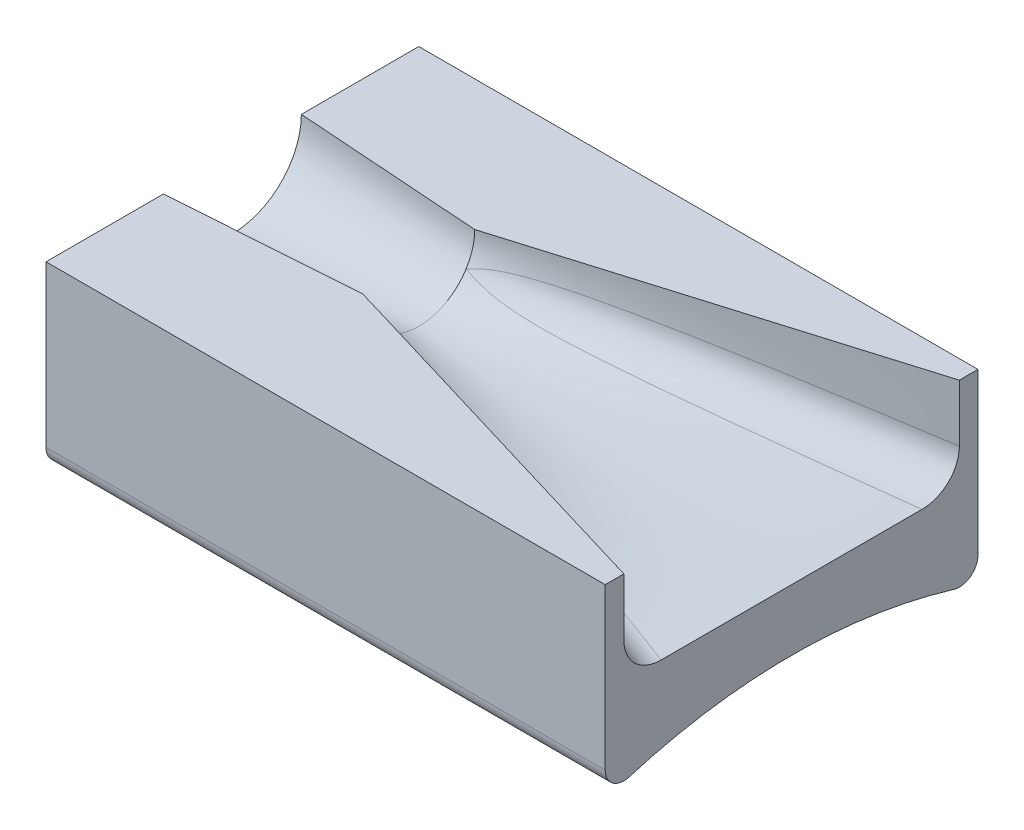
ISO-10303-21;
HEADER;
FILE_DESCRIPTION(('STEP AP214'),'2;1');
FILE_NAME('part.step','',(''),(''),'','','');
FILE_SCHEMA(('AUTOMOTIVE_DESIGN { 1 0 10303 214 1 1 1 1 }'));
ENDSEC;
DATA;
#1=APPLICATION_CONTEXT('core data for automotive mechanical design processes');
#2=APPLICATION_PROTOCOL_DEFINITION('international standard','automotive_design',2000,#1);
#3=PRODUCT_CONTEXT('',#1,'mechanical');
#4=PRODUCT('Part','Part','',(#3));
#5=PRODUCT_RELATED_PRODUCT_CATEGORY('part','',(#4));
#6=PRODUCT_DEFINITION_FORMATION('','',#4);
#7=PRODUCT_DEFINITION_CONTEXT('part definition',#1,'design');
#8=PRODUCT_DEFINITION('design','',#6,#7);
#9=PRODUCT_DEFINITION_SHAPE('','',#8);
#10=(LENGTH_UNIT() NAMED_UNIT(*) SI_UNIT(.MILLI.,.METRE.));
#11=(NAMED_UNIT(*) PLANE_ANGLE_UNIT() SI_UNIT($,.RADIAN.));
#12=(NAMED_UNIT(*) SI_UNIT($,.STERADIAN.) SOLID_ANGLE_UNIT());
#13=UNCERTAINTY_MEASURE_WITH_UNIT(LENGTH_MEASURE(1.E-05),#10,'distance_accuracy_value','');
#14=(GEOMETRIC_REPRESENTATION_CONTEXT(3) GLOBAL_UNCERTAINTY_ASSIGNED_CONTEXT((#13)) GLOBAL_UNIT_ASSIGNED_CONTEXT((#10,
#11,#12)) REPRESENTATION_CONTEXT('',''));
#15=CARTESIAN_POINT('',(0.,0.,0.));
#16=DIRECTION('',(0.,0.,1.));
#17=DIRECTION('',(1.,0.,0.));
#18=AXIS2_PLACEMENT_3D('',#15,#16,#17);
#19=CARTESIAN_POINT('',(-150.,50.,50.));
#20=DIRECTION('',(0.,1.,0.));
#21=DIRECTION('',(0.,0.,1.));
#22=AXIS2_PLACEMENT_3D('',#19,#20,#21);
#23=PLANE('',#22);
#24=DIRECTION('',(-0.997564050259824,0.,-0.0697564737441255));
#25=VECTOR('',#24,1.);
#26=CARTESIAN_POINT('',(114.509993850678,50.,0.));
#27=LINE('',#26,#25);
#28=CARTESIAN_POINT('',(-150.,50.,-18.4963405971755));
#29=VERTEX_POINT('',#28);
#30=CARTESIAN_POINT('',(-100.,50.,-15.));
#31=VERTEX_POINT('',#30);
#32=EDGE_CURVE('E276',#29,#31,#27,.F.);
#33=ORIENTED_EDGE('',*,*,#32,.T.);
#34=CARTESIAN_POINT('',(0.,50.,-45.));
#35=CARTESIAN_POINT('',(-33.3333333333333,50.,-35.));
#36=CARTESIAN_POINT('',(-66.6666666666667,50.,-25.));
#37=CARTESIAN_POINT('',(-100.,50.,-15.));
#38=B_SPLINE_CURVE_WITH_KNOTS('',3,(#34,#35,#36,#37),.UNSPECIFIED.,.F.,.F.,(4,4),(0.,1.),.UNSPECIFIED.);
#39=CARTESIAN_POINT('',(0.,50.,-45.));
#40=VERTEX_POINT('',#39);
#41=EDGE_CURVE('E292',#40,#31,#38,.T.);
#42=ORIENTED_EDGE('',*,*,#41,.F.);
#43=DIRECTION('',(0.,0.,1.));
#44=VECTOR('',#43,1.);
#45=CARTESIAN_POINT('',(0.,50.,50.));
#46=LINE('',#45,#44);
#47=CARTESIAN_POINT('',(0.,50.,-50.));
#48=VERTEX_POINT('',#47);
#49=EDGE_CURVE('E501',#48,#40,#46,.T.);
#50=ORIENTED_EDGE('',*,*,#49,.F.);
#51=DIRECTION('',(1.,0.,0.));
#52=VECTOR('',#51,1.);
#53=CARTESIAN_POINT('',(-150.,50.,-50.));
#54=LINE('',#53,#52);
#55=CARTESIAN_POINT('',(-150.,50.,-50.));
#56=VERTEX_POINT('',#55);
#57=EDGE_CURVE('E467',#56,#48,#54,.T.);
#58=ORIENTED_EDGE('',*,*,#57,.F.);
#59=DIRECTION('',(0.,0.,1.));
#60=VECTOR('',#59,1.);
#61=CARTESIAN_POINT('',(-150.,50.,50.));
#62=LINE('',#61,#60);
#63=EDGE_CURVE('E295',#56,#29,#62,.T.);
#64=ORIENTED_EDGE('',*,*,#63,.T.);
#65=EDGE_LOOP('',(#33,#42,#50,#58,#64));
#66=FACE_BOUND('',#65,.T.);
#67=ADVANCED_FACE('F181',(#66),#23,.T.);
#68=DIRECTION('',(0.997564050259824,0.,-0.0697564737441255));
#69=VECTOR('',#68,1.);
#70=CARTESIAN_POINT('',(114.509993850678,50.,0.));
#71=LINE('',#70,#69);
#72=CARTESIAN_POINT('',(-100.,50.,15.));
#73=VERTEX_POINT('',#72);
#74=CARTESIAN_POINT('',(-150.,50.,18.4963405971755));
#75=VERTEX_POINT('',#74);
#76=EDGE_CURVE('E296',#73,#75,#71,.F.);
#77=ORIENTED_EDGE('',*,*,#76,.T.);
#78=CARTESIAN_POINT('',(-150.,50.,50.));
#79=VERTEX_POINT('',#78);
#80=EDGE_CURVE('E522',#75,#79,#62,.T.);
#81=ORIENTED_EDGE('',*,*,#80,.T.);
#82=DIRECTION('',(1.,0.,0.));
#83=VECTOR('',#82,1.);
#84=CARTESIAN_POINT('',(-150.,50.,50.));
#85=LINE('',#84,#83);
#86=CARTESIAN_POINT('',(0.,50.,50.));
#87=VERTEX_POINT('',#86);
#88=EDGE_CURVE('E499',#79,#87,#85,.T.);
#89=ORIENTED_EDGE('',*,*,#88,.T.);
#90=CARTESIAN_POINT('',(0.,50.,45.));
#91=VERTEX_POINT('',#90);
#92=EDGE_CURVE('E435',#91,#87,#46,.T.);
#93=ORIENTED_EDGE('',*,*,#92,.F.);
#94=CARTESIAN_POINT('',(0.,50.,45.));
#95=CARTESIAN_POINT('',(-33.3333333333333,50.,35.));
#96=CARTESIAN_POINT('',(-66.6666666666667,50.,25.));
#97=CARTESIAN_POINT('',(-100.,50.,15.));
#98=B_SPLINE_CURVE_WITH_KNOTS('',3,(#94,#95,#96,#97),.UNSPECIFIED.,.F.,.F.,(4,4),(0.,1.),.UNSPECIFIED.);
#99=EDGE_CURVE('E301',#91,#73,#98,.T.);
#100=ORIENTED_EDGE('',*,*,#99,.T.);
#101=EDGE_LOOP('',(#77,#81,#89,#93,#100));
#102=FACE_BOUND('',#101,.T.);
#103=ADVANCED_FACE('F593',(#102),#23,.T.);
#104=CARTESIAN_POINT('',(-150.,50.,-50.));
#105=DIRECTION('',(0.,0.,-1.));
#106=DIRECTION('',(0.,1.,0.));
#107=AXIS2_PLACEMENT_3D('',#104,#105,#106);
#108=PLANE('',#107);
#109=DIRECTION('',(0.,1.,0.));
#110=VECTOR('',#109,1.);
#111=CARTESIAN_POINT('',(0.,50.,-50.));
#112=LINE('',#111,#110);
#113=CARTESIAN_POINT('',(0.,6.90261350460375,-50.));
#114=VERTEX_POINT('',#113);
#115=EDGE_CURVE('E519',#114,#48,#112,.T.);
#116=ORIENTED_EDGE('',*,*,#115,.F.);
#117=DIRECTION('',(1.,0.,0.));
#118=VECTOR('',#117,1.);
#119=CARTESIAN_POINT('',(-150.,6.90261350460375,-50.));
#120=LINE('',#119,#118);
#121=CARTESIAN_POINT('',(-150.,6.90261350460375,-50.));
#122=VERTEX_POINT('',#121);
#123=EDGE_CURVE('E472',#122,#114,#120,.T.);
#124=ORIENTED_EDGE('',*,*,#123,.F.);
#125=DIRECTION('',(0.,1.,0.));
#126=VECTOR('',#125,1.);
#127=CARTESIAN_POINT('',(-150.,50.,-50.));
#128=LINE('',#127,#126);
#129=EDGE_CURVE('E491',#122,#56,#128,.T.);
#130=ORIENTED_EDGE('',*,*,#129,.T.);
#131=ORIENTED_EDGE('',*,*,#57,.T.);
#132=EDGE_LOOP('',(#116,#124,#130,#131));
#133=FACE_BOUND('',#132,.T.);
#134=ADVANCED_FACE('F537',(#133),#108,.T.);
#135=CARTESIAN_POINT('',(-150.,6.90261350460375,-45.));
#136=DIRECTION('',(1.,0.,0.));
#137=DIRECTION('',(0.,0.,-1.));
#138=AXIS2_PLACEMENT_3D('',#135,#136,#137);
#139=CYLINDRICAL_SURFACE('',#138,5.00000000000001);
#140=CARTESIAN_POINT('',(0.,6.90261350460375,-45.));
#141=DIRECTION('',(1.,0.,0.));
#142=DIRECTION('',(0.,0.,-1.));
#143=AXIS2_PLACEMENT_3D('',#140,#141,#142);
#144=CIRCLE('',#143,5.00000000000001);
#145=CARTESIAN_POINT('',(0.,2.11796931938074,-43.5483870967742));
#146=VERTEX_POINT('',#145);
#147=EDGE_CURVE('E516',#146,#114,#144,.T.);
#148=ORIENTED_EDGE('',*,*,#147,.F.);
#149=DIRECTION('',(1.,0.,0.));
#150=VECTOR('',#149,1.);
#151=CARTESIAN_POINT('',(-150.,2.11796931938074,-43.5483870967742));
#152=LINE('',#151,#150);
#153=CARTESIAN_POINT('',(-150.,2.11796931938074,-43.5483870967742));
#154=VERTEX_POINT('',#153);
#155=EDGE_CURVE('E488',#154,#146,#152,.T.);
#156=ORIENTED_EDGE('',*,*,#155,.F.);
#157=CARTESIAN_POINT('',(-150.,6.90261350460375,-45.));
#158=DIRECTION('',(1.,0.,0.));
#159=DIRECTION('',(0.,0.,-1.));
#160=AXIS2_PLACEMENT_3D('',#157,#158,#159);
#161=CIRCLE('',#160,5.00000000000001);
#162=EDGE_CURVE('E532',#154,#122,#161,.T.);
#163=ORIENTED_EDGE('',*,*,#162,.T.);
#164=ORIENTED_EDGE('',*,*,#123,.T.);
#165=EDGE_LOOP('',(#148,#156,#163,#164));
#166=FACE_BOUND('',#165,.T.);
#167=ADVANCED_FACE('F610',(#166),#139,.T.);
#168=CARTESIAN_POINT('',(-150.,-141.42135623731,0.));
#169=DIRECTION('',(1.,0.,0.));
#170=DIRECTION('',(0.,0.,-1.));
#171=AXIS2_PLACEMENT_3D('',#168,#169,#170);
#172=CYLINDRICAL_SURFACE('',#171,150.);
#173=CARTESIAN_POINT('',(0.,-141.42135623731,0.));
#174=DIRECTION('',(-1.,0.,0.));
#175=DIRECTION('',(0.,0.,1.));
#176=AXIS2_PLACEMENT_3D('',#173,#174,#175);
#177=CIRCLE('',#176,150.);
#178=CARTESIAN_POINT('',(0.,2.11796931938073,43.5483870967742));
#179=VERTEX_POINT('',#178);
#180=EDGE_CURVE('E513',#179,#146,#177,.T.);
#181=ORIENTED_EDGE('',*,*,#180,.F.);
#182=DIRECTION('',(1.,0.,0.));
#183=VECTOR('',#182,1.);
#184=CARTESIAN_POINT('',(-150.,2.11796931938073,43.5483870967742));
#185=LINE('',#184,#183);
#186=CARTESIAN_POINT('',(-150.,2.11796931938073,43.5483870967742));
#187=VERTEX_POINT('',#186);
#188=EDGE_CURVE('E495',#187,#179,#185,.T.);
#189=ORIENTED_EDGE('',*,*,#188,.F.);
#190=CARTESIAN_POINT('',(-150.,-141.42135623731,0.));
#191=DIRECTION('',(-1.,0.,0.));
#192=DIRECTION('',(0.,0.,1.));
#193=AXIS2_PLACEMENT_3D('',#190,#191,#192);
#194=CIRCLE('',#193,150.);
#195=EDGE_CURVE('E530',#187,#154,#194,.T.);
#196=ORIENTED_EDGE('',*,*,#195,.T.);
#197=ORIENTED_EDGE('',*,*,#155,.T.);
#198=EDGE_LOOP('',(#181,#189,#196,#197));
#199=FACE_BOUND('',#198,.T.);
#200=ADVANCED_FACE('F606',(#199),#172,.F.);
#201=CARTESIAN_POINT('',(-150.,6.90261350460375,45.));
#202=DIRECTION('',(1.,0.,0.));
#203=DIRECTION('',(0.,0.,-1.));
#204=AXIS2_PLACEMENT_3D('',#201,#202,#203);
#205=CYLINDRICAL_SURFACE('',#204,5.00000000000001);
#206=CARTESIAN_POINT('',(0.,6.90261350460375,45.));
#207=DIRECTION('',(1.,0.,0.));
#208=DIRECTION('',(0.,0.,1.));
#209=AXIS2_PLACEMENT_3D('',#206,#207,#208);
#210=CIRCLE('',#209,5.00000000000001);
#211=CARTESIAN_POINT('',(0.,6.90261350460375,50.));
#212=VERTEX_POINT('',#211);
#213=EDGE_CURVE('E510',#212,#179,#210,.T.);
#214=ORIENTED_EDGE('',*,*,#213,.F.);
#215=DIRECTION('',(1.,0.,0.));
#216=VECTOR('',#215,1.);
#217=CARTESIAN_POINT('',(-150.,6.90261350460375,50.));
#218=LINE('',#217,#216);
#219=CARTESIAN_POINT('',(-150.,6.90261350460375,50.));
#220=VERTEX_POINT('',#219);
#221=EDGE_CURVE('E497',#220,#212,#218,.T.);
#222=ORIENTED_EDGE('',*,*,#221,.F.);
#223=CARTESIAN_POINT('',(-150.,6.90261350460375,45.));
#224=DIRECTION('',(1.,0.,0.));
#225=DIRECTION('',(0.,0.,1.));
#226=AXIS2_PLACEMENT_3D('',#223,#224,#225);
#227=CIRCLE('',#226,5.00000000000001);
#228=EDGE_CURVE('E527',#220,#187,#227,.T.);
#229=ORIENTED_EDGE('',*,*,#228,.T.);
#230=ORIENTED_EDGE('',*,*,#188,.T.);
#231=EDGE_LOOP('',(#214,#222,#229,#230));
#232=FACE_BOUND('',#231,.T.);
#233=ADVANCED_FACE('F602',(#232),#205,.T.);
#234=CARTESIAN_POINT('',(-150.,6.90261350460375,50.));
#235=DIRECTION('',(0.,0.,1.));
#236=DIRECTION('',(0.,-1.,0.));
#237=AXIS2_PLACEMENT_3D('',#234,#235,#236);
#238=PLANE('',#237);
#239=DIRECTION('',(0.,-1.,0.));
#240=VECTOR('',#239,1.);
#241=CARTESIAN_POINT('',(0.,6.90261350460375,50.));
#242=LINE('',#241,#240);
#243=EDGE_CURVE('E502',#87,#212,#242,.T.);
#244=ORIENTED_EDGE('',*,*,#243,.F.);
#245=ORIENTED_EDGE('',*,*,#88,.F.);
#246=DIRECTION('',(0.,-1.,0.));
#247=VECTOR('',#246,1.);
#248=CARTESIAN_POINT('',(-150.,6.90261350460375,50.));
#249=LINE('',#248,#247);
#250=EDGE_CURVE('E524',#79,#220,#249,.T.);
#251=ORIENTED_EDGE('',*,*,#250,.T.);
#252=ORIENTED_EDGE('',*,*,#221,.T.);
#253=EDGE_LOOP('',(#244,#245,#251,#252));
#254=FACE_BOUND('',#253,.T.);
#255=ADVANCED_FACE('F599',(#254),#238,.T.);
#256=CARTESIAN_POINT('',(-150.,6.90261350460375,-45.));
#257=DIRECTION('',(1.,0.,0.));
#258=DIRECTION('',(0.,0.,-1.));
#259=AXIS2_PLACEMENT_3D('',#256,#257,#258);
#260=PLANE('',#259);
#261=ORIENTED_EDGE('',*,*,#80,.F.);
#262=CARTESIAN_POINT('',(-150.,50.,0.));
#263=DIRECTION('',(1.,0.,0.));
#264=DIRECTION('',(0.,0.,-1.));
#265=AXIS2_PLACEMENT_3D('',#262,#263,#264);
#266=CIRCLE('',#265,18.4963405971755);
#267=EDGE_CURVE('E284',#29,#75,#266,.F.);
#268=ORIENTED_EDGE('',*,*,#267,.F.);
#269=ORIENTED_EDGE('',*,*,#63,.F.);
#270=ORIENTED_EDGE('',*,*,#129,.F.);
#271=ORIENTED_EDGE('',*,*,#162,.F.);
#272=ORIENTED_EDGE('',*,*,#195,.F.);
#273=ORIENTED_EDGE('',*,*,#228,.F.);
#274=ORIENTED_EDGE('',*,*,#250,.F.);
#275=EDGE_LOOP('',(#261,#268,#269,#270,#271,#272,#273,#274));
#276=FACE_BOUND('',#275,.T.);
#277=ADVANCED_FACE('F540',(#276),#260,.F.);
#278=CARTESIAN_POINT('',(0.,6.90261350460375,-45.));
#279=DIRECTION('',(1.,0.,0.));
#280=DIRECTION('',(0.,0.,-1.));
#281=AXIS2_PLACEMENT_3D('',#278,#279,#280);
#282=PLANE('',#281);
#283=DIRECTION('',(0.,-1.,0.));
#284=VECTOR('',#283,1.);
#285=CARTESIAN_POINT('',(0.,50.,45.));
#286=LINE('',#285,#284);
#287=CARTESIAN_POINT('',(0.,34.6782049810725,45.));
#288=VERTEX_POINT('',#287);
#289=EDGE_CURVE('E569',#91,#288,#286,.T.);
#290=ORIENTED_EDGE('',*,*,#289,.F.);
#291=ORIENTED_EDGE('',*,*,#92,.T.);
#292=ORIENTED_EDGE('',*,*,#243,.T.);
#293=ORIENTED_EDGE('',*,*,#213,.T.);
#294=ORIENTED_EDGE('',*,*,#180,.T.);
#295=ORIENTED_EDGE('',*,*,#147,.T.);
#296=ORIENTED_EDGE('',*,*,#115,.T.);
#297=ORIENTED_EDGE('',*,*,#49,.T.);
#298=DIRECTION('',(0.,1.,0.));
#299=VECTOR('',#298,1.);
#300=CARTESIAN_POINT('',(0.,50.,-45.));
#301=LINE('',#300,#299);
#302=CARTESIAN_POINT('',(0.,34.6782049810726,-45.));
#303=VERTEX_POINT('',#302);
#304=EDGE_CURVE('E299',#303,#40,#301,.T.);
#305=ORIENTED_EDGE('',*,*,#304,.F.);
#306=CARTESIAN_POINT('',(32.882270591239,20.1740921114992,-44.4897658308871));
#307=CARTESIAN_POINT('',(29.7218512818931,19.9426327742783,-54.5358101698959));
#308=CARTESIAN_POINT('',(31.2451574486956,30.3648815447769,-54.6810664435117));
#309=CARTESIAN_POINT('',(30.2731368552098,20.5639341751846,-43.7219794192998));
#310=CARTESIAN_POINT('',(27.1486483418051,20.3760422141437,-53.7102192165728));
#311=CARTESIAN_POINT('',(28.6432879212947,30.734738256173,-53.8722259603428));
#312=CARTESIAN_POINT('',(27.6632840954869,20.9523883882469,-42.956536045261));
#313=CARTESIAN_POINT('',(24.5677405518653,20.8104894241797,-52.882439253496));
#314=CARTESIAN_POINT('',(26.0409901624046,31.1023636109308,-53.0638915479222));
#315=CARTESIAN_POINT('',(22.4420024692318,21.7263191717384,-41.4309587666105));
#316=CARTESIAN_POINT('',(19.4046321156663,21.6789945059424,-51.2270936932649));
#317=CARTESIAN_POINT('',(20.8354769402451,31.8326113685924,-51.448261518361));
#318=CARTESIAN_POINT('',(19.8305736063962,22.1117957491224,-40.6708248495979));
#319=CARTESIAN_POINT('',(16.8237503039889,22.1128348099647,-50.3999464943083));
#320=CARTESIAN_POINT('',(18.232261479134,32.195233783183,-50.6409658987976));
#321=CARTESIAN_POINT('',(14.605988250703,22.8795713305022,-39.1564859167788));
#322=CARTESIAN_POINT('',(11.6608028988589,22.9800336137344,-48.7459517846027));
#323=CARTESIAN_POINT('',(13.0248381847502,32.9149373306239,-49.0274359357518));
#324=CARTESIAN_POINT('',(11.992831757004,23.2618703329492,-38.4022809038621));
#325=CARTESIAN_POINT('',(9.08018696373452,23.4131537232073,-47.9195635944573));
#326=CARTESIAN_POINT('',(10.4206303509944,33.2720184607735,-48.2212015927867));
#327=CARTESIAN_POINT('',(6.76461071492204,24.0230944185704,-36.9005937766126));
#328=CARTESIAN_POINT('',(3.91734306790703,24.2788943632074,-46.2669961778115));
#329=CARTESIAN_POINT('',(5.21113952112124,33.9799537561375,-46.6097990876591));
#330=CARTESIAN_POINT('',(4.14954616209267,24.4020194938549,-36.1531116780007));
#331=CARTESIAN_POINT('',(1.33673568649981,24.7112492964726,-45.4413298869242));
#332=CARTESIAN_POINT('',(2.60585652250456,34.3308079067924,-45.8046309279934));
#333=CARTESIAN_POINT('',(1.53344284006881,24.7791586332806,-35.4093896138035));
#334=CARTESIAN_POINT('',(-1.25544696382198,25.1451161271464,-44.6123443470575));
#335=CARTESIAN_POINT('',(2.14083761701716E-10,34.6782049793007,-45.0000000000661));
#336=CARTESIAN_POINT('',(1.27788922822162,24.8159996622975,-35.3367414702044));
#337=CARTESIAN_POINT('',(-1.50748271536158,25.1873004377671,-44.5317426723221));
#338=CARTESIAN_POINT('',(-0.254552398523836,34.7121385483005,-44.9213995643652));
#339=CARTESIAN_POINT('',(1.02232551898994,24.8528236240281,-35.264130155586));
#340=CARTESIAN_POINT('',(-1.75962693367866,25.2294987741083,-44.4511099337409));
#341=CARTESIAN_POINT('',(-0.509110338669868,34.74603831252,-44.8428041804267));
#342=CARTESIAN_POINT('',(0.511177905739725,24.9264374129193,-35.1189811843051));
#343=CARTESIAN_POINT('',(-2.26391579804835,25.3138872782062,-44.2898515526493));
#344=CARTESIAN_POINT('',(-1.01823730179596,34.8137702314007,-44.685623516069));
#345=CARTESIAN_POINT('',(0.255594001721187,24.9632272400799,-35.0464435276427));
#346=CARTESIAN_POINT('',(-2.51605874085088,25.3560771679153,-44.2092264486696));
#347=CARTESIAN_POINT('',(-1.27280632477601,34.8476023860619,-44.6070382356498));
#348=CARTESIAN_POINT('',(3.18154280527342E-10,24.9999999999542,-34.9739426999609));
#349=CARTESIAN_POINT('',(-2.76830562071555,25.3982803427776,-44.1285717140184));
#350=CARTESIAN_POINT('',(-1.52738088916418,34.8814007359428,-44.528458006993));
#351=CARTESIAN_POINT('',(-0.999238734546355,25.1437621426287,-34.6905045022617));
#352=CARTESIAN_POINT('',(-3.75241205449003,25.5629300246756,-43.8139083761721));
#353=CARTESIAN_POINT('',(-2.52263391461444,35.013532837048,-44.2212504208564));
#354=CARTESIAN_POINT('',(-1.99863305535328,25.287261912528,-34.4076349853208));
#355=CARTESIAN_POINT('',(-4.73809051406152,25.7277794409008,-43.4987977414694));
#356=CARTESIAN_POINT('',(-3.51797219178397,35.1451432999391,-43.9141201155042));
#357=CARTESIAN_POINT('',(-3.99774562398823,25.5737286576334,-33.8430961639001));
#358=CARTESIAN_POINT('',(-6.70953751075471,26.0573604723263,-42.8686598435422));
#359=CARTESIAN_POINT('',(-5.50882426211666,35.407266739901,-43.3000117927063));
#360=CARTESIAN_POINT('',(-4.99746387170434,25.7166956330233,-33.5614268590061));
#361=CARTESIAN_POINT('',(-7.69519838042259,26.2220745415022,-42.5536666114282));
#362=CARTESIAN_POINT('',(-6.50433805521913,35.5377797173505,-42.993033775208));
#363=CARTESIAN_POINT('',(-6.99724850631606,26.0020903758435,-32.9993480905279));
#364=CARTESIAN_POINT('',(-9.66661666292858,26.5513807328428,-41.9237620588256));
#365=CARTESIAN_POINT('',(-8.4955575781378,35.7976554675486,-42.3792242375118));
#366=CARTESIAN_POINT('',(-7.99731489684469,26.1445181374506,-32.7189386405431));
#367=CARTESIAN_POINT('',(-10.6522615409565,26.7159545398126,-41.6088863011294));
#368=CARTESIAN_POINT('',(-9.49126330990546,35.9270182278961,-42.0723927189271));
#369=CARTESIAN_POINT('',(-9.9977998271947,26.4288270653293,-32.1594527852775));
#370=CARTESIAN_POINT('',(-12.6236508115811,27.0449754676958,-40.9792152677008));
#371=CARTESIAN_POINT('',(-11.482862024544,36.1845313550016,-41.4588756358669));
#372=CARTESIAN_POINT('',(-10.9982183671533,26.5707082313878,-31.8803763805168));
#373=CARTESIAN_POINT('',(-13.6092770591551,27.2094033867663,-40.66445732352));
#374=CARTESIAN_POINT('',(-12.4787550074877,36.3126817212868,-41.1521900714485));
#375=CARTESIAN_POINT('',(-14.9717737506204,27.1330444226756,-30.774904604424));
#376=CARTESIAN_POINT('',(-17.5092453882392,27.8597255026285,-39.419230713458));
#377=CARTESIAN_POINT('',(-16.4339938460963,36.8190598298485,-39.9345734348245));
#378=CARTESIAN_POINT('',(-17.9463451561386,27.5513362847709,-29.9540025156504));
#379=CARTESIAN_POINT('',(-20.4360912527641,28.3471341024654,-38.4851998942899));
#380=CARTESIAN_POINT('',(-19.3940945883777,37.1923040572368,-39.0241992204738));
#381=CARTESIAN_POINT('',(-23.8991827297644,28.3830398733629,-28.3268677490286));
#382=CARTESIAN_POINT('',(-26.2930055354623,29.3210508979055,-36.6170121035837));
#383=CARTESIAN_POINT('',(-25.31616799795,37.9255641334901,-37.2045196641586));
#384=CARTESIAN_POINT('',(-26.8774488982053,28.7964515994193,-27.5206350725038));
#385=CARTESIAN_POINT('',(-29.2193070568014,29.8069498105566,-35.6840459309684));
#386=CARTESIAN_POINT('',(-28.2781406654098,38.2855799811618,-36.2952143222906));
#387=CARTESIAN_POINT('',(-32.8382677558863,29.6187454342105,-25.9258489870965));
#388=CARTESIAN_POINT('',(-35.0757135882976,30.7779028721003,-33.8175416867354));
#389=CARTESIAN_POINT('',(-34.2041458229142,38.989726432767,-34.4773136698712));
#390=CARTESIAN_POINT('',(-35.8208204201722,30.027627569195,-25.1372954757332));
#391=CARTESIAN_POINT('',(-38.0013517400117,31.2622356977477,-32.8854188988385));
#392=CARTESIAN_POINT('',(-37.168178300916,39.3338571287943,-33.5687183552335));
#393=CARTESIAN_POINT('',(-41.7910704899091,30.8418556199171,-23.5818977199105));
#394=CARTESIAN_POINT('',(-43.8570500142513,32.230280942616,-31.0198568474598));
#395=CARTESIAN_POINT('',(-43.0985771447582,40.0026018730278,-31.7515765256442));
#396=CARTESIAN_POINT('',(-44.7787678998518,31.2472015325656,-22.8150534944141));
#397=CARTESIAN_POINT('',(-46.7817012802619,32.713118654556,-30.0881394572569));
#398=CARTESIAN_POINT('',(-46.0649435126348,40.3272159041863,-30.8430300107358));
#399=CARTESIAN_POINT('',(-49.4603614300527,31.8808651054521,-21.6363531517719));
#400=CARTESIAN_POINT('',(-51.3803323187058,33.4716901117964,-28.622286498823));
#401=CARTESIAN_POINT('',(-50.7101870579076,40.8157400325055,-29.4199362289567));
#402=CARTESIAN_POINT('',(-51.152060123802,32.1095350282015,-21.2151005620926));
#403=CARTESIAN_POINT('',(-53.0343157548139,33.7444001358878,-28.0948968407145));
#404=CARTESIAN_POINT('',(-52.3881541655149,40.9881635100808,-28.9058139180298));
#405=CARTESIAN_POINT('',(-54.5378884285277,32.5674077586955,-20.3829248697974));
#406=CARTESIAN_POINT('',(-56.3434688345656,34.2899832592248,-27.0390315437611));
#407=CARTESIAN_POINT('',(-55.7450317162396,41.3235705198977,-27.8767635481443));
#408=CARTESIAN_POINT('',(-56.2320180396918,32.7966105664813,-19.9720017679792));
#409=CARTESIAN_POINT('',(-57.9972010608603,34.5626196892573,-26.5110214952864));
#410=CARTESIAN_POINT('',(-57.4239421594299,41.4865540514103,-27.3618354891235));
#411=CARTESIAN_POINT('',(-59.6232168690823,33.256878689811,-19.1624182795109));
#412=CARTESIAN_POINT('',(-61.306046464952,35.1084442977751,-25.453339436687));
#413=CARTESIAN_POINT('',(-60.7828225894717,41.8011822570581,-26.3305743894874));
#414=CARTESIAN_POINT('',(-61.3202860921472,33.487944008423,-18.7637579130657));
#415=CARTESIAN_POINT('',(-62.9594616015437,35.3813489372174,-24.9242231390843));
#416=CARTESIAN_POINT('',(-62.4627925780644,41.952826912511,-25.8142413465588));
#417=CARTESIAN_POINT('',(-64.7181151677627,33.9540869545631,-17.981343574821));
#418=CARTESIAN_POINT('',(-66.2679589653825,35.9283479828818,-23.8634806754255));
#419=CARTESIAN_POINT('',(-65.8239513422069,42.2421165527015,-24.7792330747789));
#420=CARTESIAN_POINT('',(-66.4188750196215,34.1891645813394,-17.5975896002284));
#421=CARTESIAN_POINT('',(-67.9209908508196,36.202092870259,-23.3325346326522));
#422=CARTESIAN_POINT('',(-67.5051401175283,42.3797615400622,-24.2605578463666));
#423=CARTESIAN_POINT('',(-68.9737433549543,34.5476372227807,-17.0360500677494));
#424=CARTESIAN_POINT('',(-70.4102388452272,36.6157864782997,-22.5306469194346));
#425=CARTESIAN_POINT('',(-70.0280612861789,42.5727052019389,-23.4795624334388));
#426=CARTESIAN_POINT('',(-69.8260032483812,34.668106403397,-16.851215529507));
#427=CARTESIAN_POINT('',(-71.2371454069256,36.7534513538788,-22.2638834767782));
#428=CARTESIAN_POINT('',(-70.8692401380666,42.6347668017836,-23.2187287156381));
#429=CARTESIAN_POINT('',(-71.5319918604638,34.9117446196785,-16.4869251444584));
#430=CARTESIAN_POINT('',(-72.8913278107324,37.0295277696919,-21.72926330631));
#431=CARTESIAN_POINT('',(-72.5520161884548,42.7536609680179,-22.6957515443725));
#432=CARTESIAN_POINT('',(-72.3857205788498,35.0349136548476,-16.3074692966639));
#433=CARTESIAN_POINT('',(-73.7182421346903,37.1678743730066,-21.4615299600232));
#434=CARTESIAN_POINT('',(-73.3936133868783,42.8104935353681,-22.4336080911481));
#435=CARTESIAN_POINT('',(-74.0949477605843,35.2849222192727,-15.95475496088));
#436=CARTESIAN_POINT('',(-75.3725256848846,37.4455788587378,-20.9247139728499));
#437=CARTESIAN_POINT('',(-75.0772896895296,42.9180491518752,-21.9075983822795));
#438=CARTESIAN_POINT('',(-74.9504462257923,35.4117617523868,-15.7814964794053));
#439=CARTESIAN_POINT('',(-76.199485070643,37.5848613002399,-20.655772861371));
#440=CARTESIAN_POINT('',(-75.919368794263,42.9687721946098,-21.6437321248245));
#441=CARTESIAN_POINT('',(-76.6636254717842,35.6704778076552,-15.4422362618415));
#442=CARTESIAN_POINT('',(-77.854004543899,37.8648031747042,-20.1162169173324));
#443=CARTESIAN_POINT('',(-77.6040950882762,43.0629528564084,-21.1136958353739));
#444=CARTESIAN_POINT('',(-77.5213062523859,35.8023543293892,-15.276234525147));
#445=CARTESIAN_POINT('',(-78.6810958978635,38.0053736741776,-19.8457660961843));
#446=CARTESIAN_POINT('',(-78.4467422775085,43.1064104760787,-20.8475258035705));
#447=CARTESIAN_POINT('',(-79.2394115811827,36.0730798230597,-14.9528601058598));
#448=CARTESIAN_POINT('',(-80.3360834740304,38.2883821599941,-19.3027967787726));
#449=CARTESIAN_POINT('',(-80.1327170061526,43.1845286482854,-20.3120573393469));
#450=CARTESIAN_POINT('',(-80.0998360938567,36.2119287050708,-14.7954873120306));
#451=CARTESIAN_POINT('',(-81.1634408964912,38.4307140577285,-19.0304695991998));
#452=CARTESIAN_POINT('',(-80.9760445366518,43.2191893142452,-20.0427589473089));
#453=CARTESIAN_POINT('',(-81.8242734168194,36.4994835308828,-14.4912293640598));
#454=CARTESIAN_POINT('',(-82.8193155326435,38.7179606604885,-18.4832679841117));
#455=CARTESIAN_POINT('',(-82.6635720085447,43.2776233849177,-19.4998014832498));
#456=CARTESIAN_POINT('',(-82.6882862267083,36.6481894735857,-14.34434420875));
#457=CARTESIAN_POINT('',(-83.6472105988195,38.8627468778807,-18.2086178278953));
#458=CARTESIAN_POINT('',(-83.5077719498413,43.3013967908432,-19.2261424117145));
#459=CARTESIAN_POINT('',(-84.4210751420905,36.9597117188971,-14.0634468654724));
#460=CARTESIAN_POINT('',(-85.3047028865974,39.1558169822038,-17.6561994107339));
#461=CARTESIAN_POINT('',(-85.1973137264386,43.3351603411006,-18.6726123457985));
#462=CARTESIAN_POINT('',(-85.2898512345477,37.1225279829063,-13.9294346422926));
#463=CARTESIAN_POINT('',(-86.1335896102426,39.3039455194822,-17.3786916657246));
#464=CARTESIAN_POINT('',(-86.0426555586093,43.3451505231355,-18.3927413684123));
#465=CARTESIAN_POINT('',(-86.5979353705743,37.3824787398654,-13.7404910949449));
#466=CARTESIAN_POINT('',(-87.3820610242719,39.530298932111,-16.958563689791));
#467=CARTESIAN_POINT('',(-87.3118581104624,43.3465983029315,-17.9659835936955));
#468=CARTESIAN_POINT('',(-87.0347832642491,37.4717500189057,-13.6795223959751));
#469=CARTESIAN_POINT('',(-87.7973458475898,39.6061219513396,-16.8184638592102));
#470=CARTESIAN_POINT('',(-87.7351237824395,43.3448246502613,-17.8225725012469));
#471=CARTESIAN_POINT('',(-87.9104335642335,37.6567983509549,-13.5621184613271));
#472=CARTESIAN_POINT('',(-88.6286678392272,39.7591513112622,-16.5372922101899));
#473=CARTESIAN_POINT('',(-88.5821341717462,43.336032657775,-17.5328587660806));
#474=CARTESIAN_POINT('',(-88.3492359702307,37.7525754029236,-13.5056832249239));
#475=CARTESIAN_POINT('',(-89.0446040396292,39.8363325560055,-16.3962582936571));
#476=CARTESIAN_POINT('',(-89.0058788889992,43.3290143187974,-17.3865561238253));
#477=CARTESIAN_POINT('',(-89.1816963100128,37.941426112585,-13.4037101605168));
#478=CARTESIAN_POINT('',(-89.8327610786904,39.9839335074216,-16.1283556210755));
#479=CARTESIAN_POINT('',(-89.8081991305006,43.3099515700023,-17.1063149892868));
#480=CARTESIAN_POINT('',(-89.5751169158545,38.033676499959,-13.3576535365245));
#481=CARTESIAN_POINT('',(-90.2045746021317,40.0541256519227,-16.0016989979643));
#482=CARTESIAN_POINT('',(-90.1867152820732,43.2985311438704,-16.9727456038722));
#483=CARTESIAN_POINT('',(-90.3641292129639,38.2260266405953,-13.2700080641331));
#484=CARTESIAN_POINT('',(-90.949203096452,40.1959645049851,-15.7475446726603));
#485=CARTESIAN_POINT('',(-90.9443063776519,43.2700576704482,-16.7020437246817));
#486=CARTESIAN_POINT('',(-90.7597209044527,38.3261263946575,-13.2284192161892));
#487=CARTESIAN_POINT('',(-91.321951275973,40.2675922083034,-15.6200722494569));
#488=CARTESIAN_POINT('',(-91.323381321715,43.2530046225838,-16.5649112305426));
#489=CARTESIAN_POINT('',(-91.5534567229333,38.535977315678,-13.1501321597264));
#490=CARTESIAN_POINT('',(-92.0687571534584,40.4124860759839,-15.3642924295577));
#491=CARTESIAN_POINT('',(-92.0822173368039,43.2123483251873,-16.2861919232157));
#492=CARTESIAN_POINT('',(-91.9516008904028,38.6457286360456,-13.1134340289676));
#493=CARTESIAN_POINT('',(-92.4427584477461,40.4857342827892,-15.2360063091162));
#494=CARTESIAN_POINT('',(-92.4619784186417,43.1887449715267,-16.1446050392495));
#495=CARTESIAN_POINT('',(-92.7508641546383,38.8771615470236,-13.0453031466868));
#496=CARTESIAN_POINT('',(-93.1924742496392,40.6340054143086,-14.9786271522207));
#497=CARTESIAN_POINT('',(-93.22234480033,43.1338003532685,-15.8557663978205));
#498=CARTESIAN_POINT('',(-93.1519832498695,38.9988431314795,-13.0138703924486));
#499=CARTESIAN_POINT('',(-93.5681519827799,40.7090136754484,-14.8495478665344));
#500=CARTESIAN_POINT('',(-93.6029500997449,43.1024590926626,-15.7085146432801));
#501=CARTESIAN_POINT('',(-93.9576132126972,39.256981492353,-12.9564943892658));
#502=CARTESIAN_POINT('',(-94.3217413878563,40.8609391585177,-14.5907835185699));
#503=CARTESIAN_POINT('',(-94.3651543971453,43.0308122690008,-15.4068166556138));
#504=CARTESIAN_POINT('',(-94.3621237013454,39.3934366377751,-12.9305505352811));
#505=CARTESIAN_POINT('',(-94.6996539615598,40.9378489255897,-14.4610973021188));
#506=CARTESIAN_POINT('',(-94.7467532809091,42.9905076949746,-15.2523712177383));
#507=CARTESIAN_POINT('',(-95.1750246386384,39.6846625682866,-12.8840463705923));
#508=CARTESIAN_POINT('',(-95.4585150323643,41.0935806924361,-14.2013923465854));
#509=CARTESIAN_POINT('',(-95.5112381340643,42.8994180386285,-14.9341659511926));
#510=CARTESIAN_POINT('',(-95.5834150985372,39.8394334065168,-12.8634860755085));
#511=CARTESIAN_POINT('',(-95.8395286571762,41.1724096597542,-14.0713478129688));
#512=CARTESIAN_POINT('',(-95.894124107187,42.8486329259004,-14.7704060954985));
#513=CARTESIAN_POINT('',(-96.4043604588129,40.1714487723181,-12.8270110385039));
#514=CARTESIAN_POINT('',(-96.6056042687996,41.3316233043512,-13.8113418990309));
#515=CARTESIAN_POINT('',(-96.6614982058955,42.7347313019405,-14.4306462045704));
#516=CARTESIAN_POINT('',(-96.8169152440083,40.3486926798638,-12.811096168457));
#517=CARTESIAN_POINT('',(-96.9908364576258,41.4120400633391,-13.6813160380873));
#518=CARTESIAN_POINT('',(-97.0459862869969,42.6716151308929,-14.2546465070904));
#519=CARTESIAN_POINT('',(-97.6461310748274,40.7302008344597,-12.7820994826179));
#520=CARTESIAN_POINT('',(-97.7667486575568,41.5734839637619,-13.42193216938));
#521=CARTESIAN_POINT('',(-97.8169759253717,42.530975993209,-13.8863767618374));
#522=CARTESIAN_POINT('',(-98.0627920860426,40.9344648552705,-12.7690176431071));
#523=CARTESIAN_POINT('',(-98.1577683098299,41.6545837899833,-13.2924510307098));
#524=CARTESIAN_POINT('',(-98.2034774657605,42.4534531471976,-13.6941068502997));
#525=CARTESIAN_POINT('',(-98.611234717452,41.2226531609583,-12.7514185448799));
#526=CARTESIAN_POINT('',(-98.6756547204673,41.7600177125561,-13.1234583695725));
#527=CARTESIAN_POINT('',(-98.7118690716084,42.3409635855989,-13.4276179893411));
#528=CARTESIAN_POINT('',(-98.7415483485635,41.2925497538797,-12.7472089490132));
#529=CARTESIAN_POINT('',(-98.7988382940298,41.78495192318,-13.0834440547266));
#530=CARTESIAN_POINT('',(-98.8326403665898,42.3134667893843,-13.3633121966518));
#531=CARTESIAN_POINT('',(-99.0024362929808,41.435432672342,-12.7385656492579));
#532=CARTESIAN_POINT('',(-99.0460083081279,41.8345749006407,-13.0035640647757));
#533=CARTESIAN_POINT('',(-99.0744378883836,42.2568136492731,-13.2323494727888));
#534=CARTESIAN_POINT('',(-99.1330106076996,41.5084190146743,-12.7341319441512));
#535=CARTESIAN_POINT('',(-99.1700165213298,41.8592682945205,-12.9636910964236));
#536=CARTESIAN_POINT('',(-99.1954641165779,42.2276572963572,-13.1656925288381));
#537=CARTESIAN_POINT('',(-99.501080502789,41.7184563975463,-12.7211083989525));
#538=CARTESIAN_POINT('',(-99.5204851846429,41.9283165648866,-12.8516398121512));
#539=CARTESIAN_POINT('',(-99.5367293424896,42.143118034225,-12.9743162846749));
#540=CARTESIAN_POINT('',(-99.7388122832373,41.8591506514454,-12.7120813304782));
#541=CARTESIAN_POINT('',(-99.7481436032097,41.9723065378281,-12.7795957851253));
#542=CARTESIAN_POINT('',(-99.7572770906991,42.0857618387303,-12.8466344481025));
#543=CARTESIAN_POINT('',(-99.9844345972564,42.0099458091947,-12.701535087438));
#544=CARTESIAN_POINT('',(-99.9849858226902,42.0167082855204,-12.7055539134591));
#545=CARTESIAN_POINT('',(-99.9855338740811,42.0234754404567,-12.709565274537));
#546=CARTESIAN_POINT('',(-99.992217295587,42.0147294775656,-12.7011996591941));
#547=CARTESIAN_POINT('',(-99.9924920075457,42.0181140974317,-12.7032082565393));
#548=CARTESIAN_POINT('',(-99.9927667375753,42.0214987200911,-12.7052168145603));
#549=CARTESIAN_POINT('',(-100.000000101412,42.0195188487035,-12.7008629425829));
#550=CARTESIAN_POINT('',(-100.000000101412,42.0195188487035,-12.7008629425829));
#551=CARTESIAN_POINT('',(-100.000000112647,42.0195188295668,-12.7008629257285));
#552=(BOUNDED_SURFACE() B_SPLINE_SURFACE(3,2,((#306,#307,#308),(#309,#310,#311),(#312,#313,
#314),(#315,#316,#317),(#318,#319,#320),(#321,#322,#323),(#324,#325,#326),(#327,#328,#329),
(#330,#331,#332),(#333,#334,#335),(#336,#337,#338),(#339,#340,#341),(#342,#343,#344),(#345,#346,
#347),(#348,#349,#350),(#351,#352,#353),(#354,#355,#356),(#357,#358,#359),(#360,#361,#362),
(#363,#364,#365),(#366,#367,#368),(#369,#370,#371),(#372,#373,#374),(#375,#376,#377),(#378,#379,
#380),(#381,#382,#383),(#384,#385,#386),(#387,#388,#389),(#390,#391,#392),(#393,#394,#395),
(#396,#397,#398),(#399,#400,#401),(#402,#403,#404),(#405,#406,#407),(#408,#409,#410),(#411,#412,
#413),(#414,#415,#416),(#417,#418,#419),(#420,#421,#422),(#423,#424,#425),(#426,#427,#428),
(#429,#430,#431),(#432,#433,#434),(#435,#436,#437),(#438,#439,#440),(#441,#442,#443),(#444,#445,
#446),(#447,#448,#449),(#450,#451,#452),(#453,#454,#455),(#456,#457,#458),(#459,#460,#461),
(#462,#463,#464),(#465,#466,#467),(#468,#469,#470),(#471,#472,#473),(#474,#475,#476),(#477,#478,
#479),(#480,#481,#482),(#483,#484,#485),(#486,#487,#488),(#489,#490,#491),(#492,#493,#494),
(#495,#496,#497),(#498,#499,#500),(#501,#502,#503),(#504,#505,#506),(#507,#508,#509),(#510,#511,
#512),(#513,#514,#515),(#516,#517,#518),(#519,#520,#521),(#522,#523,#524),(#525,#526,#527),
(#528,#529,#530),(#531,#532,#533),(#534,#535,#536),(#537,#538,#539),(#540,#541,#542),(#543,#544,
#545),(#546,#547,#548),(#549,#550,#551)),.UNSPECIFIED.,.F.,.F.,
.F.) B_SPLINE_SURFACE_WITH_KNOTS((4,2,2,2,3,2,3,2,2,2,2,2,2,2,2,2,2,2,2,2,2,2,2,2,2,2,2,2,2,2,2,
2,2,2,2,2,2,2,2,4),(3,3),(0.,8.25322833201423,16.5064373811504,24.7596504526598,
33.0128828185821,33.8190973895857,34.6253119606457,37.777187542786,40.9290620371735,
44.0809704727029,47.2328801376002,56.5977254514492,65.9625716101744,75.327363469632,
84.6921635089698,89.9857594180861,95.27935573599,100.572960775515,105.866564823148,
108.513464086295,111.160362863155,113.807264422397,116.454165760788,119.101032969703,
121.747899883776,124.394759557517,125.718188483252,127.041617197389,128.222255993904,
129.402894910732,130.583552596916,131.764209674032,132.944736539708,134.125266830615,
135.305764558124,136.486252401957,136.853579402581,137.22090839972,137.888212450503,
137.910047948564),(0.,1.),
.UNSPECIFIED.) GEOMETRIC_REPRESENTATION_ITEM() RATIONAL_B_SPLINE_SURFACE(((1.,0.688485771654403,
1.),(1.,0.690787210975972,1.),(1.,0.693167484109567,1.),(1.,0.698105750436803,1.),(1.,
0.700663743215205,1.),(1.,0.705977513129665,1.),(1.,0.708733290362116,1.),(1.,0.714468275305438,
1.),(1.,0.717447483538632,1.),(1.,0.72055122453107,1.),(1.,0.720854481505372,1.),(1.,
0.721158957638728,1.),(1.,0.721770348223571,1.),(1.,0.722077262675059,1.),(1.,0.722385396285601,
1.),(1.,0.723590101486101,1.),(1.,0.724813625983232,1.),(1.,0.727300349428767,1.),(1.,
0.728563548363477,1.),(1.,0.731131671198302,1.),(1.,0.732436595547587,1.),(1.,0.735090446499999,
1.),(1.,0.736439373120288,1.),(1.,0.741888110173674,1.),(1.,0.74616912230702,1.),(1.,
0.755214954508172,1.),(1.,0.759979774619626,1.),(1.,0.770094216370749,1.),(1.,0.77544383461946,
1.),(1.,0.786866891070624,1.),(1.,0.792940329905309,1.),(1.,0.803177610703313,1.),(1.,
0.807023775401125,1.),(1.,0.815069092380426,1.),(1.,0.819268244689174,1.),(1.,0.828090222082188,
1.),(1.,0.832713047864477,1.),(1.,0.842479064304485,1.),(1.,0.847622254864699,1.),(1.,
0.855831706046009,1.),(1.,0.858650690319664,1.),(1.,0.864476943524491,1.),(1.,0.867484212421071,
1.),(1.,0.873714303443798,1.),(1.,0.876937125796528,1.),(1.,0.88363165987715,1.),(1.,
0.887103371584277,1.),(1.,0.894335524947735,1.),(1.,0.89809596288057,1.),(1.,0.905953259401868,
1.),(1.,0.910050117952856,1.),(1.,0.918630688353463,1.),(1.,0.923114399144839,1.),(1.,
0.930162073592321,1.),(1.,0.932564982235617,1.),(1.,0.937480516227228,1.),(1.,0.939993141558,
1.),(1.,0.944849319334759,1.),(1.,0.947181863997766,1.),(1.,0.95192617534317,1.),(1.,
0.95433794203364,1.),(1.,0.959225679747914,1.),(1.,0.961701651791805,1.),(1.,0.966689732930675,
1.),(1.,0.969201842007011,1.),(1.,0.974208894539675,1.),(1.,0.976703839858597,1.),(1.,
0.981589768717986,1.),(1.,0.983980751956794,1.),(1.,0.98851829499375,1.),(1.,0.990664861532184,
1.),(1.,0.994494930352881,1.),(1.,0.996178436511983,1.),(1.,0.997865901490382,1.),(1.,
0.998227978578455,1.),(1.,0.998862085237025,1.),(1.,0.999134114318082,1.),(1.,0.999754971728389,
1.),(1.,0.999985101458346,1.),(1.,0.999999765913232,1.),(1.,0.999999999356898,1.),(1.,1.,1.))) REPRESENTATION_ITEM('') SURFACE());
#553=CARTESIAN_POINT('',(0.,34.6782049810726,-45.));
#554=CARTESIAN_POINT('',(0.,34.409942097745,-45.0000348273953));
#555=CARTESIAN_POINT('',(0.,34.1416660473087,-44.9889143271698));
#556=CARTESIAN_POINT('',(0.,33.6069531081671,-44.9443816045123));
#557=CARTESIAN_POINT('',(0.,33.3405163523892,-44.9109677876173));
#558=CARTESIAN_POINT('',(0.,32.811553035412,-44.8218954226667));
#559=CARTESIAN_POINT('',(0.,32.5490241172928,-44.7662508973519));
#560=CARTESIAN_POINT('',(0.,32.0296132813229,-44.6329970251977));
#561=CARTESIAN_POINT('',(0.,31.772731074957,-44.5553888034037));
#562=CARTESIAN_POINT('',(0.,31.2661926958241,-44.3785829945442));
#563=CARTESIAN_POINT('',(0.,31.0165446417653,-44.2793621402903));
#564=CARTESIAN_POINT('',(0.,30.5265834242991,-44.0600643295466));
#565=CARTESIAN_POINT('',(0.,30.2862702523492,-43.9399873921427));
#566=CARTESIAN_POINT('',(0.,29.8167910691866,-43.6799057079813));
#567=CARTESIAN_POINT('',(0.,29.5876212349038,-43.5399078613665));
#568=CARTESIAN_POINT('',(0.,29.1419583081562,-43.2410197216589));
#569=CARTESIAN_POINT('',(0.,28.9254650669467,-43.0821296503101));
#570=CARTESIAN_POINT('',(0.,28.5080580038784,-42.7478288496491));
#571=CARTESIAN_POINT('',(0.,28.3070481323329,-42.5725379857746));
#572=CARTESIAN_POINT('',(0.,27.920286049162,-42.2058699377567));
#573=CARTESIAN_POINT('',(0.,27.7345337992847,-42.0144927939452));
#574=CARTESIAN_POINT('',(0.,27.3793892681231,-41.6170629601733));
#575=CARTESIAN_POINT('',(0.,27.2099998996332,-41.4110076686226));
#576=CARTESIAN_POINT('',(0.,26.8885848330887,-40.9857798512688));
#577=CARTESIAN_POINT('',(0.,26.7365592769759,-40.7666072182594));
#578=CARTESIAN_POINT('',(0.,26.4474892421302,-40.3117184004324));
#579=CARTESIAN_POINT('',(0.,26.3108532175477,-40.07574266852));
#580=CARTESIAN_POINT('',(0.,26.0572328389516,-39.5934547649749));
#581=CARTESIAN_POINT('',(0.,25.9402495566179,-39.347142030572));
#582=CARTESIAN_POINT('',(0.,25.7264267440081,-38.8458606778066));
#583=CARTESIAN_POINT('',(0.,25.6295910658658,-38.5908904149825));
#584=CARTESIAN_POINT('',(0.,25.4564585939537,-38.0741676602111));
#585=CARTESIAN_POINT('',(0.,25.3801591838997,-37.8124160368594));
#586=CARTESIAN_POINT('',(0.,25.2092823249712,-37.1272503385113));
#587=CARTESIAN_POINT('',(0.,25.1305594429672,-36.6997329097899));
#588=CARTESIAN_POINT('',(0.,25.0520935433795,-36.0544331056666));
#589=CARTESIAN_POINT('',(0.,25.0325411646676,-35.8388276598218));
#590=CARTESIAN_POINT('',(0.,25.0064970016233,-35.4068177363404));
#591=CARTESIAN_POINT('',(0.,25.0000058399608,-35.1904132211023));
#592=CARTESIAN_POINT('',(0.,24.9999999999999,-34.9739426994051));
#593=B_SPLINE_CURVE_WITH_KNOTS('',3,(#553,#554,#555,#556,#557,#558,#559,#560,#561,#562,#563,
#564,#565,#566,#567,#568,#569,#570,#571,#572,#573,#574,#575,#576,#577,#578,#579,#580,#581,#582,
#583,#584,#585,#586,#587,#588,#589,#590,#591,#592),.UNSPECIFIED.,.F.,.F.,(4,2,2,2,2,2,2,2,2,2,2,
2,2,2,2,2,2,2,2,4),(0.,0.804577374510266,1.60921230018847,2.41334047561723,3.21742746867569,
4.02238442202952,4.82734063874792,5.63201871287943,6.43668734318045,7.2358765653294,
8.03506378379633,8.83439300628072,9.63372876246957,10.4508447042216,11.2680051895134,
12.0853217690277,12.9025341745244,14.2027981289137,14.8519458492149,15.5011245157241),.UNSPECIFIED.);
#594=CARTESIAN_POINT('',(0.,25.,-34.973942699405));
#595=VERTEX_POINT('',#594);
#596=EDGE_CURVE('E13',#303,#595,#593,.T.);
#597=ORIENTED_EDGE('',*,*,#596,.T.);
#598=DIRECTION('',(0.,0.,-1.));
#599=VECTOR('',#598,1.);
#600=CARTESIAN_POINT('',(0.,25.,-45.));
#601=LINE('',#600,#599);
#602=CARTESIAN_POINT('',(0.,25.,34.9739426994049));
#603=VERTEX_POINT('',#602);
#604=EDGE_CURVE('E186',#603,#595,#601,.T.);
#605=ORIENTED_EDGE('',*,*,#604,.F.);
#606=CARTESIAN_POINT('',(31.2451574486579,30.3648815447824,54.6810664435));
#607=CARTESIAN_POINT('',(29.7218512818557,19.9426327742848,54.5358101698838));
#608=CARTESIAN_POINT('',(32.8822705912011,20.1740921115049,44.489765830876));
#609=CARTESIAN_POINT('',(28.6432879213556,30.7347382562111,53.8722259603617));
#610=CARTESIAN_POINT('',(27.1486483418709,20.376042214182,53.7102192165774));
#611=CARTESIAN_POINT('',(30.2731368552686,20.5639341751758,43.7219794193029));
#612=CARTESIAN_POINT('',(26.0409901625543,31.1023636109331,53.0638915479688));
#613=CARTESIAN_POINT('',(24.567740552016,20.810489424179,52.8824392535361));
#614=CARTESIAN_POINT('',(27.663284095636,20.9523883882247,42.9565360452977));
#615=CARTESIAN_POINT('',(20.8354769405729,31.8326113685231,51.4482615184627));
#616=CARTESIAN_POINT('',(19.404632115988,21.6789945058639,51.227093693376));
#617=CARTESIAN_POINT('',(22.4420024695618,21.7263191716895,41.4309587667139));
#618=CARTESIAN_POINT('',(18.2322614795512,32.1952337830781,50.640965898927));
#619=CARTESIAN_POINT('',(16.8237503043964,22.1128348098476,50.399946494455));
#620=CARTESIAN_POINT('',(19.8305736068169,22.1117957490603,40.6708248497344));
#621=CARTESIAN_POINT('',(13.0248381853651,32.914937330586,49.0274359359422));
#622=CARTESIAN_POINT('',(11.6608028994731,22.9800336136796,48.7459517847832));
#623=CARTESIAN_POINT('',(14.6059882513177,22.8795713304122,39.1564859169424));
#624=CARTESIAN_POINT('',(10.4206303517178,33.2720184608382,48.2212015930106));
#625=CARTESIAN_POINT('',(9.08018696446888,23.4131537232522,47.9195635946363));
#626=CARTESIAN_POINT('',(11.9928317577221,23.2618703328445,38.4022809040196));
#627=CARTESIAN_POINT('',(5.21113952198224,33.9799537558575,46.6097990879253));
#628=CARTESIAN_POINT('',(3.91734306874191,24.2788943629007,46.2669961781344));
#629=CARTESIAN_POINT('',(6.76461071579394,24.0230944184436,36.9005937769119));
#630=CARTESIAN_POINT('',(2.60585652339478,34.3308079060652,45.8046309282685));
#631=CARTESIAN_POINT('',(1.33673568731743,24.7112492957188,45.4413298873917));
#632=CARTESIAN_POINT('',(4.14954616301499,24.4020194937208,36.1531116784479));
#633=CARTESIAN_POINT('',(1.04491472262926E-09,34.6782049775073,45.0000000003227));
#634=CARTESIAN_POINT('',(-1.25544696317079,25.1451161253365,44.6123443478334));
#635=CARTESIAN_POINT('',(1.53344284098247,24.779158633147,35.4093896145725));
#636=CARTESIAN_POINT('',(-0.254552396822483,34.7121385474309,44.9213995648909));
#637=CARTESIAN_POINT('',(-1.50748271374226,25.187300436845,44.5317426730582));
#638=CARTESIAN_POINT('',(1.27788922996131,24.8159996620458,35.3367414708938));
#639=CARTESIAN_POINT('',(-0.509110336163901,34.7460383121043,44.8428041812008));
#640=CARTESIAN_POINT('',(-1.75962693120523,25.2294987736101,44.4511099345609));
#641=CARTESIAN_POINT('',(1.02232552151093,24.8528236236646,35.2641301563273));
#642=CARTESIAN_POINT('',(-1.01823729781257,34.813770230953,44.6856235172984));
#643=CARTESIAN_POINT('',(-2.26391579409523,25.3138872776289,44.2898515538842));
#644=CARTESIAN_POINT('',(0.511177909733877,24.9264374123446,35.1189811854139));
#645=CARTESIAN_POINT('',(-1.27280632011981,34.8476023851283,44.6070382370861));
#646=CARTESIAN_POINT('',(-2.51605873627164,25.3560771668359,44.2092264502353));
#647=CARTESIAN_POINT('',(0.255594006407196,24.9632272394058,35.046443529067));
#648=CARTESIAN_POINT('',(-1.52738088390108,34.8814007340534,44.5284580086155));
#649=CARTESIAN_POINT('',(-2.76830561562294,25.3982803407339,44.1285717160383));
#650=CARTESIAN_POINT('',(5.65129177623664E-09,24.9999999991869,34.9739427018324));
#651=CARTESIAN_POINT('',(-2.45782990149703,35.0049294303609,44.2412536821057));
#652=CARTESIAN_POINT('',(-3.68843255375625,25.5522256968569,43.834365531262));
#653=CARTESIAN_POINT('',(-0.93417518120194,25.1344013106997,34.7089598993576));
#654=CARTESIAN_POINT('',(-3.38835343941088,35.1280020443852,43.9541168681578));
#655=CARTESIAN_POINT('',(-4.60993771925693,25.7063463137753,43.539767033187));
#656=CARTESIAN_POINT('',(-1.86848638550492,25.2685733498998,34.4444743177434));
#657=CARTESIAN_POINT('',(-5.24955359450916,35.3731911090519,43.379976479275));
#658=CARTESIAN_POINT('',(-6.45302004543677,26.0144837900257,42.9506449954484));
#659=CARTESIAN_POINT('',(-3.73739114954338,25.536452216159,33.9165486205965));
#660=CARTESIAN_POINT('',(-6.18023021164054,35.4953075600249,43.0929729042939));
#661=CARTESIAN_POINT('',(-7.37450949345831,26.1684863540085,42.6561491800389));
#662=CARTESIAN_POINT('',(-4.67198470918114,25.6701590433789,33.6531085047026));
#663=CARTESIAN_POINT('',(-8.0417508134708,35.7385416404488,42.5190940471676));
#664=CARTESIAN_POINT('',(-9.21756652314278,26.4763844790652,42.0672310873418));
#665=CARTESIAN_POINT('',(-6.54147479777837,25.9371022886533,33.1273218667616));
#666=CARTESIAN_POINT('',(-8.97259479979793,35.8596592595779,42.2322187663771));
#667=CARTESIAN_POINT('',(-10.1390426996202,26.6302651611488,41.7728376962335));
#668=CARTESIAN_POINT('',(-7.47637132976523,26.0703387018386,32.8649753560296));
#669=CARTESIAN_POINT('',(-10.834445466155,36.1008452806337,41.6585964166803));
#670=CARTESIAN_POINT('',(-11.9820752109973,26.9379155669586,41.1841235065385));
#671=CARTESIAN_POINT('',(-9.34646971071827,26.3363347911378,32.3414353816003));
#672=CARTESIAN_POINT('',(-11.7654521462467,36.2209136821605,41.371849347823));
#673=CARTESIAN_POINT('',(-12.9035358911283,27.0916697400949,40.8898329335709));
#674=CARTESIAN_POINT('',(-10.2816715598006,26.46909446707,32.0802419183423));
#675=CARTESIAN_POINT('',(-15.7204918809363,36.7286031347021,40.1540857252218));
#676=CARTESIAN_POINT('',(-16.8026956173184,27.7420086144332,39.6447501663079));
#677=CARTESIAN_POINT('',(-14.2548490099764,27.0320004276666,30.9733251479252));
#678=CARTESIAN_POINT('',(-18.7453231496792,37.1109841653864,39.2236682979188));
#679=CARTESIAN_POINT('',(-19.7936467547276,28.2402005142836,38.690186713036));
#680=CARTESIAN_POINT('',(-17.2943368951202,27.4598448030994,30.1333741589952));
#681=CARTESIAN_POINT('',(-24.7969278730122,37.8620889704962,37.3639677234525));
#682=CARTESIAN_POINT('',(-25.7789535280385,29.2356567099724,36.7809269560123));
#683=CARTESIAN_POINT('',(-23.3771351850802,28.31042735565,28.4686124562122));
#684=CARTESIAN_POINT('',(-27.8237013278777,38.2308127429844,36.4346845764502));
#685=CARTESIAN_POINT('',(-28.7693319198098,29.7322775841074,35.8274878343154));
#686=CARTESIAN_POINT('',(-26.4204455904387,28.7331655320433,27.643801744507));
#687=CARTESIAN_POINT('',(-33.8793890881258,38.9518142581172,34.5768824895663));
#688=CARTESIAN_POINT('',(-34.7541173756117,30.7246446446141,33.9200124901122));
#689=CARTESIAN_POINT('',(-32.5115102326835,29.5738823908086,26.0124820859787));
#690=CARTESIAN_POINT('',(-36.9083033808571,39.3040920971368,33.6483635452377));
#691=CARTESIAN_POINT('',(-37.743796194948,31.219627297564,32.9674741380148));
#692=CARTESIAN_POINT('',(-35.5592644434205,29.9918611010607,25.2059730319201));
#693=CARTESIAN_POINT('',(-42.9685620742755,39.9883736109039,31.7913997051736));
#694=CARTESIAN_POINT('',(-43.7278440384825,32.2089483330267,31.0610203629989));
#695=CARTESIAN_POINT('',(-41.6601201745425,30.8240843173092,23.6155095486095));
#696=CARTESIAN_POINT('',(-45.9999064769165,40.3203772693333,30.8629548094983));
#697=CARTESIAN_POINT('',(-46.7164697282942,32.7023580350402,30.1089329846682));
#698=CARTESIAN_POINT('',(-44.7132216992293,31.2383288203,22.8315551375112));
#699=CARTESIAN_POINT('',(-50.71018721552,40.8157394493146,29.4199359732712));
#700=CARTESIAN_POINT('',(-51.3803345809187,33.4716906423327,28.6222855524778));
#701=CARTESIAN_POINT('',(-49.4603617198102,31.8808656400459,21.6363537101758));
#702=CARTESIAN_POINT('',(-52.3881544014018,40.9881633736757,28.905813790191));
#703=CARTESIAN_POINT('',(-53.0343165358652,33.7444003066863,28.0948965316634));
#704=CARTESIAN_POINT('',(-51.1520603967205,32.1095351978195,21.2151006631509));
#705=CARTESIAN_POINT('',(-55.745032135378,41.3235707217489,27.8767634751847));
#706=CARTESIAN_POINT('',(-56.3434687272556,34.2899831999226,27.0390316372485));
#707=CARTESIAN_POINT('',(-54.5378888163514,32.5674076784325,20.3829246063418));
#708=CARTESIAN_POINT('',(-57.423942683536,41.4865541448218,27.361835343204));
#709=CARTESIAN_POINT('',(-57.9972014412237,34.5626197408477,26.511021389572));
#710=CARTESIAN_POINT('',(-56.2320185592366,32.796610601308,19.9720015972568));
#711=CARTESIAN_POINT('',(-60.7828232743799,41.8011822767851,26.3305741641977));
#712=CARTESIAN_POINT('',(-61.3060472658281,35.108444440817,25.4533391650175));
#713=CARTESIAN_POINT('',(-59.6232175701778,33.2568788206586,19.1624181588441));
#714=CARTESIAN_POINT('',(-62.462793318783,41.952826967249,25.8142411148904));
#715=CARTESIAN_POINT('',(-62.959462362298,35.3813490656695,24.9242228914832));
#716=CARTESIAN_POINT('',(-61.3202868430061,33.4879441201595,18.7637577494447));
#717=CARTESIAN_POINT('',(-65.8239522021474,42.2421166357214,24.7792328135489));
#718=CARTESIAN_POINT('',(-66.2679597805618,35.928348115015,23.8634804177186));
#719=CARTESIAN_POINT('',(-64.7181160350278,33.9540870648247,17.9813433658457));
#720=CARTESIAN_POINT('',(-67.5051410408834,42.3797616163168,24.2605575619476));
#721=CARTESIAN_POINT('',(-67.9209917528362,36.2020930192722,23.3325343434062));
#722=CARTESIAN_POINT('',(-66.4188759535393,34.1891647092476,17.5975893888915));
#723=CARTESIAN_POINT('',(-70.0280622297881,42.572705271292,23.4795621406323));
#724=CARTESIAN_POINT('',(-70.4102397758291,36.615786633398,22.5306466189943));
#725=CARTESIAN_POINT('',(-68.9737443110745,34.5476373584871,17.0360498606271));
#726=CARTESIAN_POINT('',(-70.8692410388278,42.6347668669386,23.2187284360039));
#727=CARTESIAN_POINT('',(-71.237146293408,36.7534515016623,22.26388319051));
#728=CARTESIAN_POINT('',(-69.8260041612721,34.668106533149,16.851215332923));
#729=CARTESIAN_POINT('',(-72.5520170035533,42.7536610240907,22.6957512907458));
#730=CARTESIAN_POINT('',(-72.8913286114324,37.0295279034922,21.7292630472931));
#731=CARTESIAN_POINT('',(-71.5319926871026,34.9117447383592,16.4869249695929));
#732=CARTESIAN_POINT('',(-73.3936141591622,42.8104935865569,22.4336078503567));
#733=CARTESIAN_POINT('',(-73.7182428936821,37.1678745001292,21.461529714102));
#734=CARTESIAN_POINT('',(-72.3857213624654,35.0349137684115,16.3074691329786));
#735=CARTESIAN_POINT('',(-75.0772903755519,42.9180491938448,21.9075981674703));
#736=CARTESIAN_POINT('',(-75.3725263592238,37.4455789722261,20.924713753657));
#737=CARTESIAN_POINT('',(-74.0949484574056,35.2849223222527,15.9547548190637));
#738=CARTESIAN_POINT('',(-75.919369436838,42.9687722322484,21.6437319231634));
#739=CARTESIAN_POINT('',(-76.1994857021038,37.5848614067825,20.655772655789));
#740=CARTESIAN_POINT('',(-74.9504468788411,35.4117618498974,15.7814963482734));
#741=CARTESIAN_POINT('',(-77.6040956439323,43.0629528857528,21.1136956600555));
#742=CARTESIAN_POINT('',(-77.8540050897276,37.8648032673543,20.1162167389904));
#743=CARTESIAN_POINT('',(-76.6636260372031,35.670477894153,15.4422361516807));
#744=CARTESIAN_POINT('',(-78.4467427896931,43.1064105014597,20.8475256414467));
#745=CARTESIAN_POINT('',(-78.6810964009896,38.0053737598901,19.845765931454));
#746=CARTESIAN_POINT('',(-77.5213067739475,35.8023544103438,15.2762344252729));
#747=CARTESIAN_POINT('',(-80.1327174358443,43.1845286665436,20.3120572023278));
#748=CARTESIAN_POINT('',(-80.3360838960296,38.2883822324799,19.3027966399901));
#749=CARTESIAN_POINT('',(-79.2394120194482,36.0730798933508,14.9528600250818));
#750=CARTESIAN_POINT('',(-80.9760449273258,43.219189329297,20.0427588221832));
#751=CARTESIAN_POINT('',(-81.16344128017,38.430714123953,19.0304694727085));
#752=CARTESIAN_POINT('',(-80.0998364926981,36.2119287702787,14.795487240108));
#753=CARTESIAN_POINT('',(-82.6635723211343,43.277623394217,19.4998013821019));
#754=CARTESIAN_POINT('',(-82.8193158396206,38.7179607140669,18.4832678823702));
#755=CARTESIAN_POINT('',(-81.8242737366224,36.4994835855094,14.4912293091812));
#756=CARTESIAN_POINT('',(-83.5077722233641,43.3013967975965,19.2261423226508));
#757=CARTESIAN_POINT('',(-83.6472108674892,38.8627469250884,18.2086177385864));
#758=CARTESIAN_POINT('',(-82.688286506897,36.6481895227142,14.34434416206));
#759=CARTESIAN_POINT('',(-85.197313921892,43.3351603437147,18.6726122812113));
#760=CARTESIAN_POINT('',(-85.304703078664,39.1558170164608,17.6561993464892));
#761=CARTESIAN_POINT('',(-84.4210753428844,36.9597117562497,14.0634468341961));
#762=CARTESIAN_POINT('',(-86.0426557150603,43.3451505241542,18.3927413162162));
#763=CARTESIAN_POINT('',(-86.1335897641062,39.3039455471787,17.3786916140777));
#764=CARTESIAN_POINT('',(-85.2898513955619,37.1225280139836,13.9294346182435));
#765=CARTESIAN_POINT('',(-87.3118582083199,43.3465983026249,17.9659835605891));
#766=CARTESIAN_POINT('',(-87.3820611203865,39.5302989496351,16.9585636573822));
#767=CARTESIAN_POINT('',(-86.5979354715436,37.3824787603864,13.7404910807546));
#768=CARTESIAN_POINT('',(-87.735123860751,43.3448246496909,17.8225724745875));
#769=CARTESIAN_POINT('',(-87.7973459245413,39.6061219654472,16.8184638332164));
#770=CARTESIAN_POINT('',(-87.034783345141,37.4717500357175,13.6795223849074));
#771=CARTESIAN_POINT('',(-88.5821342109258,43.3360326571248,17.5328587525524));
#772=CARTESIAN_POINT('',(-88.6286678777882,39.7591513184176,16.5372921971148));
#773=CARTESIAN_POINT('',(-87.9104336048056,37.6567983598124,13.5621184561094));
#774=CARTESIAN_POINT('',(-89.0058789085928,43.3290143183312,17.3865561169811));
#775=CARTESIAN_POINT('',(-89.0446040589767,39.8363325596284,16.3962582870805));
#776=CARTESIAN_POINT('',(-88.3492359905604,37.752575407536,13.5056832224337));
#777=CARTESIAN_POINT('',(-89.8081991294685,43.3099515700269,17.1063149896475));
#778=CARTESIAN_POINT('',(-89.8327610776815,39.9839335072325,16.1283556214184));
#779=CARTESIAN_POINT('',(-89.1816963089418,37.9414261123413,13.4037101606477));
#780=CARTESIAN_POINT('',(-90.1867152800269,43.298531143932,16.9727456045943));
#781=CARTESIAN_POINT('',(-90.2045746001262,40.0541256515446,16.0016989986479));
#782=CARTESIAN_POINT('',(-89.5751169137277,38.03367649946,13.3576535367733));
#783=CARTESIAN_POINT('',(-90.9443063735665,43.2700576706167,16.7020437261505));
#784=CARTESIAN_POINT('',(-90.949203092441,40.1959645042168,15.7475446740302));
#785=CARTESIAN_POINT('',(-90.3641292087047,38.2260266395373,13.2700080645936));
#786=CARTESIAN_POINT('',(-91.3233813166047,43.2530046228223,16.5649112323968));
#787=CARTESIAN_POINT('',(-91.3219512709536,40.2675922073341,15.6200722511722));
#788=CARTESIAN_POINT('',(-90.759720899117,38.3261263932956,13.2284192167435));
#789=CARTESIAN_POINT('',(-92.0822173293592,43.2123483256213,16.2861919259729));
#790=CARTESIAN_POINT('',(-92.0687571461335,40.4124860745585,15.3642924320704));
#791=CARTESIAN_POINT('',(-91.5534567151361,38.5359773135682,13.1501321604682));
#792=CARTESIAN_POINT('',(-92.4619784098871,43.1887449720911,16.1446050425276));
#793=CARTESIAN_POINT('',(-92.4427584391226,40.4857342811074,15.2360063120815));
#794=CARTESIAN_POINT('',(-91.9516008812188,38.6457286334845,13.1134340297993));
#795=CARTESIAN_POINT('',(-93.2223447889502,43.1338003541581,15.8557664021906));
#796=CARTESIAN_POINT('',(-93.1924742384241,40.6340054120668,14.9786271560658));
#797=CARTESIAN_POINT('',(-92.750864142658,38.8771615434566,13.0453031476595));
#798=CARTESIAN_POINT('',(-93.6029500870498,43.102459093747,15.7085146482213));
#799=CARTESIAN_POINT('',(-93.5681519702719,40.7090136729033,14.8495478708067));
#800=CARTESIAN_POINT('',(-93.1519832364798,38.9988431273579,13.0138703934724));
#801=CARTESIAN_POINT('',(-94.365154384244,43.030812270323,15.4068166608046));
#802=CARTESIAN_POINT('',(-94.3217413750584,40.8609391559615,14.5907835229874));
#803=CARTESIAN_POINT('',(-93.9576131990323,39.2569814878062,12.9564943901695));
#804=CARTESIAN_POINT('',(-94.7467532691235,42.9905076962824,15.2523712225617));
#805=CARTESIAN_POINT('',(-94.6996539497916,40.9378489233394,14.4610973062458));
#806=CARTESIAN_POINT('',(-94.3621236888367,39.393436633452,12.9305505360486));
#807=CARTESIAN_POINT('',(-95.5112381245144,42.8994180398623,14.9341659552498));
#808=CARTESIAN_POINT('',(-95.4585150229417,41.0935806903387,14.2013923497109));
#809=CARTESIAN_POINT('',(-95.1750246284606,39.6846625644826,12.8840463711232));
#810=CARTESIAN_POINT('',(-95.894124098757,42.8486329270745,14.7704060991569));
#811=CARTESIAN_POINT('',(-95.8395286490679,41.1724096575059,14.0713478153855));
#812=CARTESIAN_POINT('',(-95.5834150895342,39.8394334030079,12.8634860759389));
#813=CARTESIAN_POINT('',(-96.6614981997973,42.7347313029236,14.4306462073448));
#814=CARTESIAN_POINT('',(-96.605604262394,41.3316233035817,13.8113419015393));
#815=CARTESIAN_POINT('',(-96.4043604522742,40.1714487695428,12.8270110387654));
#816=CARTESIAN_POINT('',(-97.0459862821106,42.671615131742,14.2546465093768));
#817=CARTESIAN_POINT('',(-96.9908364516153,41.4120400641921,13.681316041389));
#818=CARTESIAN_POINT('',(-96.8169152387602,40.3486926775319,12.8110961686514));
#819=CARTESIAN_POINT('',(-97.8169759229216,42.530975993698,13.8863767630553));
#820=CARTESIAN_POINT('',(-97.7667486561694,41.5734839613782,13.4219321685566));
#821=CARTESIAN_POINT('',(-97.6461310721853,40.7302008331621,12.7820994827));
#822=CARTESIAN_POINT('',(-98.2034774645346,42.4534531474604,13.6941068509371));
#823=CARTESIAN_POINT('',(-98.1577683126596,41.6545837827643,13.2924510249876));
#824=CARTESIAN_POINT('',(-98.062792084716,40.9344648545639,12.7690176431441));
#825=CARTESIAN_POINT('',(-98.7118690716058,42.3409635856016,13.4276179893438));
#826=CARTESIAN_POINT('',(-98.675654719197,41.7600177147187,13.1234583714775));
#827=CARTESIAN_POINT('',(-98.6112347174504,41.2226531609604,12.7514185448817));
#828=CARTESIAN_POINT('',(-98.8326403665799,42.3134667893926,13.3633121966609));
#829=CARTESIAN_POINT('',(-98.7988382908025,41.7849519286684,13.0834440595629));
#830=CARTESIAN_POINT('',(-98.741548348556,41.2925497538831,12.747208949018));
#831=CARTESIAN_POINT('',(-99.0744378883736,42.2568136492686,13.23234947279));
#832=CARTESIAN_POINT('',(-99.0460083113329,41.8345748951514,13.0035640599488));
#833=CARTESIAN_POINT('',(-99.0024362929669,41.4354326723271,12.738565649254));
#834=CARTESIAN_POINT('',(-99.1954641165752,42.2276572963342,13.1656925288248));
#835=CARTESIAN_POINT('',(-99.1700165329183,41.8592682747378,12.9636910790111));
#836=CARTESIAN_POINT('',(-99.1330106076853,41.5084190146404,12.7341319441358));
#837=CARTESIAN_POINT('',(-99.5367293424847,42.1431180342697,12.974316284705));
#838=CARTESIAN_POINT('',(-99.5204851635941,41.9283166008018,12.8516398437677));
#839=CARTESIAN_POINT('',(-99.5010805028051,41.718456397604,12.721108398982));
#840=CARTESIAN_POINT('',(-99.7572770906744,42.0857618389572,12.8466344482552));
#841=CARTESIAN_POINT('',(-99.7481434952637,41.9723067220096,12.7795959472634));
#842=CARTESIAN_POINT('',(-99.7388122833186,41.8591506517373,12.7120813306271));
#843=CARTESIAN_POINT('',(-99.9855338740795,42.0234754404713,12.7095652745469));
#844=CARTESIAN_POINT('',(-99.9849858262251,42.0167082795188,12.7055539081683));
#845=CARTESIAN_POINT('',(-99.9844345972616,42.0099458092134,12.7015350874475));
#846=CARTESIAN_POINT('',(-99.9927667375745,42.0214987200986,12.7052168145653));
#847=CARTESIAN_POINT('',(-99.9924920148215,42.0181140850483,12.7032082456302));
#848=CARTESIAN_POINT('',(-99.9922172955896,42.0147294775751,12.701199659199));
#849=CARTESIAN_POINT('',(-100.000000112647,42.0195188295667,12.7008629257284));
#850=CARTESIAN_POINT('',(-100.000000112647,42.0195188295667,12.7008629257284));
#851=CARTESIAN_POINT('',(-100.000000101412,42.0195188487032,12.7008629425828));
#852=(BOUNDED_SURFACE() B_SPLINE_SURFACE(3,2,((#606,#607,#608),(#609,#610,#611),(#612,#613,
#614),(#615,#616,#617),(#618,#619,#620),(#621,#622,#623),(#624,#625,#626),(#627,#628,#629),
(#630,#631,#632),(#633,#634,#635),(#636,#637,#638),(#639,#640,#641),(#642,#643,#644),(#645,#646,
#647),(#648,#649,#650),(#651,#652,#653),(#654,#655,#656),(#657,#658,#659),(#660,#661,#662),
(#663,#664,#665),(#666,#667,#668),(#669,#670,#671),(#672,#673,#674),(#675,#676,#677),(#678,#679,
#680),(#681,#682,#683),(#684,#685,#686),(#687,#688,#689),(#690,#691,#692),(#693,#694,#695),
(#696,#697,#698),(#699,#700,#701),(#702,#703,#704),(#705,#706,#707),(#708,#709,#710),(#711,#712,
#713),(#714,#715,#716),(#717,#718,#719),(#720,#721,#722),(#723,#724,#725),(#726,#727,#728),
(#729,#730,#731),(#732,#733,#734),(#735,#736,#737),(#738,#739,#740),(#741,#742,#743),(#744,#745,
#746),(#747,#748,#749),(#750,#751,#752),(#753,#754,#755),(#756,#757,#758),(#759,#760,#761),
(#762,#763,#764),(#765,#766,#767),(#768,#769,#770),(#771,#772,#773),(#774,#775,#776),(#777,#778,
#779),(#780,#781,#782),(#783,#784,#785),(#786,#787,#788),(#789,#790,#791),(#792,#793,#794),
(#795,#796,#797),(#798,#799,#800),(#801,#802,#803),(#804,#805,#806),(#807,#808,#809),(#810,#811,
#812),(#813,#814,#815),(#816,#817,#818),(#819,#820,#821),(#822,#823,#824),(#825,#826,#827),
(#828,#829,#830),(#831,#832,#833),(#834,#835,#836),(#837,#838,#839),(#840,#841,#842),(#843,#844,
#845),(#846,#847,#848),(#849,#850,#851)),.UNSPECIFIED.,.F.,.F.,
.F.) B_SPLINE_SURFACE_WITH_KNOTS((4,2,2,2,3,2,3,2,2,2,2,2,2,2,2,2,2,2,2,2,2,2,2,2,2,2,2,2,2,2,2,
2,2,2,2,2,2,2,2,4),(3,3),(0.,8.25322833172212,16.5064373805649,24.7596504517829,
33.0128828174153,33.8190973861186,34.6253119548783,37.5719591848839,40.5186053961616,
43.4652820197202,46.411959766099,55.9820355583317,65.5521127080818,75.1221337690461,
84.6921625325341,89.985758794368,95.2793554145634,100.572960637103,105.866564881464,
108.513464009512,111.160362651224,113.807264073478,116.454165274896,119.101032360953,
121.747899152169,124.394758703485,125.718187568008,127.041616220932,128.222255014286,
129.40289392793,130.583551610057,131.764208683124,132.944735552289,134.125265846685,
135.305763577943,136.486251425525,136.853578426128,137.220907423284,137.888211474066,
137.910046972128),(0.,1.),
.UNSPECIFIED.) GEOMETRIC_REPRESENTATION_ITEM() RATIONAL_B_SPLINE_SURFACE(((1.,0.68848577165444,
1.),(1.,0.690787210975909,1.),(1.,0.693167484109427,1.),(1.,0.698105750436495,1.),(1.,
0.700663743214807,1.),(1.,0.705977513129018,1.),(1.,0.708733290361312,1.),(1.,0.7144682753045,
1.),(1.,0.717447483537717,1.),(1.,0.720551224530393,1.),(1.,0.72085448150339,1.),(1.,
0.721158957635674,1.),(1.,0.721770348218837,1.),(1.,0.722077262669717,1.),(1.,0.722385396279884,
1.),(1.,0.723511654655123,1.),(1.,0.724654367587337,1.),(1.,0.726974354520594,1.),(1.,
0.728151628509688,1.),(1.,0.730542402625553,1.),(1.,0.731755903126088,1.),(1.,0.734220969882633,
1.),(1.,0.735472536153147,1.),(1.,0.74087359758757,1.),(1.,0.745213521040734,1.),(1.,
0.754392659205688,1.),(1.,0.759231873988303,1.),(1.,0.769515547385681,1.),(1.,0.774960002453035,
1.),(1.,0.786600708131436,1.),(1.,0.792796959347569,1.),(1.,0.803177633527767,1.),(1.,
0.807023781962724,1.),(1.,0.815069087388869,1.),(1.,0.819268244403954,1.),(1.,0.828090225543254,
1.),(1.,0.832713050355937,1.),(1.,0.842479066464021,1.),(1.,0.847622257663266,1.),(1.,
0.855831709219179,1.),(1.,0.858650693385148,1.),(1.,0.864476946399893,1.),(1.,0.867484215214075,
1.),(1.,0.873714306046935,1.),(1.,0.876937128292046,1.),(1.,0.883631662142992,1.),(1.,
0.887103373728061,1.),(1.,0.894335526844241,1.),(1.,0.898095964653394,1.),(1.,0.905953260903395,
1.),(1.,0.910050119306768,1.),(1.,0.918630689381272,1.),(1.,0.923114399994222,1.),(1.,
0.930162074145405,1.),(1.,0.93256498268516,1.),(1.,0.937480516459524,1.),(1.,0.939993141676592,
1.),(1.,0.944849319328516,1.),(1.,0.947181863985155,1.),(1.,0.951926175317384,1.),(1.,
0.954337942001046,1.),(1.,0.959225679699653,1.),(1.,0.961701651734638,1.),(1.,0.966689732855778,
1.),(1.,0.969201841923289,1.),(1.,0.974208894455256,1.),(1.,0.976703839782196,1.),(1.,
0.981589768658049,1.),(1.,0.9839807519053,1.),(1.,0.988518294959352,1.),(1.,0.990664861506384,
1.),(1.,0.994494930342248,1.),(1.,0.99617843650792,1.),(1.,0.997865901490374,1.),(1.,
0.998227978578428,1.),(1.,0.998862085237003,1.),(1.,0.999134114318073,1.),(1.,0.99975497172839,
1.),(1.,0.999985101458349,1.),(1.,0.999999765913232,1.),(1.,0.999999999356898,1.),(1.,1.,1.))) REPRESENTATION_ITEM('') SURFACE());
#853=CARTESIAN_POINT('',(0.,25.,34.973942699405));
#854=CARTESIAN_POINT('',(0.,24.999975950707,35.2667007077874));
#855=CARTESIAN_POINT('',(0.,25.0118766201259,35.5594806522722));
#856=CARTESIAN_POINT('',(0.,25.0596186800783,36.1431414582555));
#857=CARTESIAN_POINT('',(0.,25.0954651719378,36.4340219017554));
#858=CARTESIAN_POINT('',(0.,25.1912649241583,37.0122650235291));
#859=CARTESIAN_POINT('',(0.,25.2512557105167,37.2996215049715));
#860=CARTESIAN_POINT('',(0.,25.3952352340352,37.8682429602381));
#861=CARTESIAN_POINT('',(0.,25.4792220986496,38.1495084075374));
#862=CARTESIAN_POINT('',(0.,25.6711093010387,38.7043679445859));
#863=CARTESIAN_POINT('',(0.,25.7790545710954,38.9779465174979));
#864=CARTESIAN_POINT('',(0.,26.0182932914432,39.5146941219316));
#865=CARTESIAN_POINT('',(0.,26.1495856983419,39.7778636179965));
#866=CARTESIAN_POINT('',(0.,26.4347064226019,40.2913941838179));
#867=CARTESIAN_POINT('',(0.,26.5885140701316,40.5417667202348));
#868=CARTESIAN_POINT('',(0.,26.9178340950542,41.027804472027));
#869=CARTESIAN_POINT('',(0.,27.093345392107,41.2634704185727));
#870=CARTESIAN_POINT('',(0.,27.4574368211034,41.7088694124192));
#871=CARTESIAN_POINT('',(0.,27.6452078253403,41.9192641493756));
#872=CARTESIAN_POINT('',(0.,28.0384347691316,42.3228294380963));
#873=CARTESIAN_POINT('',(0.,28.2438904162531,42.5160002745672));
#874=CARTESIAN_POINT('',(0.,28.6710633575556,42.8834966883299));
#875=CARTESIAN_POINT('',(0.,28.8927825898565,43.0578200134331));
#876=CARTESIAN_POINT('',(0.,29.3508109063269,43.3861000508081));
#877=CARTESIAN_POINT('',(0.,29.5871192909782,43.5400577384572));
#878=CARTESIAN_POINT('',(0.,30.0622062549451,43.8202378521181));
#879=CARTESIAN_POINT('',(0.,30.3004549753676,43.9473596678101));
#880=CARTESIAN_POINT('',(0.,30.7869381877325,44.1807862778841));
#881=CARTESIAN_POINT('',(0.,31.0351725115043,44.2870914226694));
#882=CARTESIAN_POINT('',(0.,31.5396661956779,44.4780719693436));
#883=CARTESIAN_POINT('',(0.,31.7959208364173,44.5627598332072));
#884=CARTESIAN_POINT('',(0.,32.3146035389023,44.7100162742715));
#885=CARTESIAN_POINT('',(0.,32.577029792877,44.7725912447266));
#886=CARTESIAN_POINT('',(0.,33.144277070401,44.8826975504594));
#887=CARTESIAN_POINT('',(0.,33.4497791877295,44.9267829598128));
#888=CARTESIAN_POINT('',(0.,33.9097394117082,44.9707655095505));
#889=CARTESIAN_POINT('',(0.,34.0632221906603,44.9817354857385));
#890=CARTESIAN_POINT('',(0.,34.370530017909,44.9963524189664));
#891=CARTESIAN_POINT('',(0.,34.5243550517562,44.9999996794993));
#892=CARTESIAN_POINT('',(0.,34.6782049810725,45.));
#893=B_SPLINE_CURVE_WITH_KNOTS('',3,(#853,#854,#855,#856,#857,#858,#859,#860,#861,#862,#863,
#864,#865,#866,#867,#868,#869,#870,#871,#872,#873,#874,#875,#876,#877,#878,#879,#880,#881,#882,
#883,#884,#885,#886,#887,#888,#889,#890,#891,#892),.UNSPECIFIED.,.F.,.F.,(4,2,2,2,2,2,2,2,2,2,2,
2,2,2,2,2,2,2,2,4),(0.,0.878065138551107,1.75631739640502,2.63593997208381,3.51549392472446,
4.39671156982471,5.27788984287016,6.15826417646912,7.03859470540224,7.88353182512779,
8.72845497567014,9.57347897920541,10.4184624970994,11.2276075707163,12.0367390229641,
12.8454029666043,13.653832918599,14.5782383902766,15.0397132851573,15.501169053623),.UNSPECIFIED.);
#894=EDGE_CURVE('E192',#603,#288,#893,.T.);
#895=ORIENTED_EDGE('',*,*,#894,.T.);
#896=EDGE_LOOP('',(#290,#291,#292,#293,#294,#295,#296,#297,#305,#597,#605,#895));
#897=FACE_BOUND('',#896,.T.);
#898=ADVANCED_FACE('F337',(#897),#282,.T.);
#899=CARTESIAN_POINT('',(0.,25.,45.));
#900=CARTESIAN_POINT('',(-33.3333333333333,30.6731729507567,34.2336209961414));
#901=CARTESIAN_POINT('',(-66.6666666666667,36.3463459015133,23.4672419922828));
#902=CARTESIAN_POINT('',(-100.,42.01951885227,12.7008629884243));
#903=CARTESIAN_POINT('',(0.,27.0833333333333,45.));
#904=CARTESIAN_POINT('',(-33.3333333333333,32.259983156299,34.3579832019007));
#905=CARTESIAN_POINT('',(-66.6666666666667,37.4366329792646,23.7159664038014));
#906=CARTESIAN_POINT('',(-100.,42.6132828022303,13.0739496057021));
#907=CARTESIAN_POINT('',(0.,31.25,45.));
#908=CARTESIAN_POINT('',(-33.3333333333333,35.4510701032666,34.5789075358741));
#909=CARTESIAN_POINT('',(-66.6666666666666,39.6521402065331,24.1578150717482));
#910=CARTESIAN_POINT('',(-99.9999999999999,43.8532103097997,13.7367226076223));
#911=CARTESIAN_POINT('',(0.,37.5,45.));
#912=CARTESIAN_POINT('',(-33.3333333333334,40.2779436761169,34.8203641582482));
#913=CARTESIAN_POINT('',(-66.6666666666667,43.0558873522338,24.6407283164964));
#914=CARTESIAN_POINT('',(-100.,45.8338310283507,14.4610924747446));
#915=CARTESIAN_POINT('',(0.,43.75,45.));
#916=CARTESIAN_POINT('',(-33.3333333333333,45.1320861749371,34.9671682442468));
#917=CARTESIAN_POINT('',(-66.6666666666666,46.5141723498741,24.9343364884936));
#918=CARTESIAN_POINT('',(-99.9999999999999,47.8962585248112,14.9015047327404));
#919=CARTESIAN_POINT('',(0.,47.9166666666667,45.));
#920=CARTESIAN_POINT('',(-33.3333333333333,48.3773616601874,35.));
#921=CARTESIAN_POINT('',(-66.6666666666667,48.8380566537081,25.));
#922=CARTESIAN_POINT('',(-100.,49.2987516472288,15.));
#923=CARTESIAN_POINT('',(0.,50.,45.));
#924=CARTESIAN_POINT('',(-33.3333333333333,50.,35.));
#925=CARTESIAN_POINT('',(-66.6666666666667,50.,25.));
#926=CARTESIAN_POINT('',(-100.,50.,15.));
#927=B_SPLINE_SURFACE_WITH_KNOTS('',3,3,((#899,#900,#901,#902),(#903,#904,#905,#906),(#907,#908,
#909,#910),(#911,#912,#913,#914),(#915,#916,#917,#918),(#919,#920,#921,#922),(#923,#924,#925,
#926)),.UNSPECIFIED.,.F.,.F.,.F.,(4,1,1,1,4),(4,4),(0.500952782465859,0.528178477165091,
0.555404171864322,0.582629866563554,0.609855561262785),(0.,1.),.UNSPECIFIED.);
#928=CARTESIAN_POINT('',(31.2451574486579,30.3648815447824,54.6810664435));
#929=CARTESIAN_POINT('',(28.6432879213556,30.7347382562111,53.8722259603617));
#930=CARTESIAN_POINT('',(26.0409901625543,31.1023636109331,53.0638915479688));
#931=CARTESIAN_POINT('',(20.8354769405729,31.8326113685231,51.4482615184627));
#932=CARTESIAN_POINT('',(18.2322614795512,32.1952337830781,50.640965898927));
#933=CARTESIAN_POINT('',(13.0248381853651,32.914937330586,49.0274359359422));
#934=CARTESIAN_POINT('',(10.4206303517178,33.2720184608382,48.2212015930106));
#935=CARTESIAN_POINT('',(5.21113952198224,33.9799537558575,46.6097990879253));
#936=CARTESIAN_POINT('',(2.60585652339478,34.3308079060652,45.8046309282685));
#937=CARTESIAN_POINT('',(1.04491472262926E-09,34.6782049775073,45.0000000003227));
#938=CARTESIAN_POINT('',(-0.254552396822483,34.7121385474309,44.9213995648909));
#939=CARTESIAN_POINT('',(-0.509110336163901,34.7460383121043,44.8428041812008));
#940=CARTESIAN_POINT('',(-1.01823729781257,34.813770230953,44.6856235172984));
#941=CARTESIAN_POINT('',(-1.27280632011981,34.8476023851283,44.6070382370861));
#942=CARTESIAN_POINT('',(-1.52738088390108,34.8814007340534,44.5284580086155));
#943=CARTESIAN_POINT('',(-2.45782990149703,35.0049294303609,44.2412536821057));
#944=CARTESIAN_POINT('',(-3.38835343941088,35.1280020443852,43.9541168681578));
#945=CARTESIAN_POINT('',(-5.24955359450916,35.3731911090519,43.379976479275));
#946=CARTESIAN_POINT('',(-6.18023021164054,35.4953075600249,43.0929729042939));
#947=CARTESIAN_POINT('',(-8.0417508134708,35.7385416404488,42.5190940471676));
#948=CARTESIAN_POINT('',(-8.97259479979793,35.8596592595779,42.2322187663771));
#949=CARTESIAN_POINT('',(-10.834445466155,36.1008452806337,41.6585964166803));
#950=CARTESIAN_POINT('',(-11.7654521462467,36.2209136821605,41.371849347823));
#951=CARTESIAN_POINT('',(-15.7204918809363,36.7286031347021,40.1540857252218));
#952=CARTESIAN_POINT('',(-18.7453231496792,37.1109841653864,39.2236682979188));
#953=CARTESIAN_POINT('',(-24.7969278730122,37.8620889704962,37.3639677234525));
#954=CARTESIAN_POINT('',(-27.8237013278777,38.2308127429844,36.4346845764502));
#955=CARTESIAN_POINT('',(-33.8793890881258,38.9518142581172,34.5768824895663));
#956=CARTESIAN_POINT('',(-36.9083033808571,39.3040920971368,33.6483635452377));
#957=CARTESIAN_POINT('',(-42.9685620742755,39.9883736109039,31.7913997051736));
#958=CARTESIAN_POINT('',(-45.9999064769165,40.3203772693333,30.8629548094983));
#959=CARTESIAN_POINT('',(-50.71018721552,40.8157394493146,29.4199359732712));
#960=CARTESIAN_POINT('',(-52.3881544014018,40.9881633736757,28.905813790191));
#961=CARTESIAN_POINT('',(-55.745032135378,41.3235707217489,27.8767634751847));
#962=CARTESIAN_POINT('',(-57.423942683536,41.4865541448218,27.361835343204));
#963=CARTESIAN_POINT('',(-60.7828232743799,41.8011822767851,26.3305741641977));
#964=CARTESIAN_POINT('',(-62.462793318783,41.952826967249,25.8142411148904));
#965=CARTESIAN_POINT('',(-65.8239522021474,42.2421166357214,24.7792328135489));
#966=CARTESIAN_POINT('',(-67.5051410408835,42.3797616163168,24.2605575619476));
#967=CARTESIAN_POINT('',(-70.0280622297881,42.572705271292,23.4795621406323));
#968=CARTESIAN_POINT('',(-70.8692410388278,42.6347668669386,23.2187284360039));
#969=CARTESIAN_POINT('',(-72.5520170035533,42.7536610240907,22.6957512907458));
#970=CARTESIAN_POINT('',(-73.3936141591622,42.8104935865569,22.4336078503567));
#971=CARTESIAN_POINT('',(-75.0772903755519,42.9180491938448,21.9075981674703));
#972=CARTESIAN_POINT('',(-75.919369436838,42.9687722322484,21.6437319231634));
#973=CARTESIAN_POINT('',(-77.6040956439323,43.0629528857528,21.1136956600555));
#974=CARTESIAN_POINT('',(-78.4467427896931,43.1064105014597,20.8475256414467));
#975=CARTESIAN_POINT('',(-80.1327174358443,43.1845286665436,20.3120572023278));
#976=CARTESIAN_POINT('',(-80.9760449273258,43.219189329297,20.0427588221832));
#977=CARTESIAN_POINT('',(-82.6635723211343,43.277623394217,19.4998013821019));
#978=CARTESIAN_POINT('',(-83.5077722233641,43.3013967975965,19.2261423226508));
#979=CARTESIAN_POINT('',(-85.197313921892,43.3351603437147,18.6726122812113));
#980=CARTESIAN_POINT('',(-86.0426557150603,43.3451505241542,18.3927413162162));
#981=CARTESIAN_POINT('',(-87.3118582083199,43.3465983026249,17.9659835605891));
#982=CARTESIAN_POINT('',(-87.735123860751,43.3448246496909,17.8225724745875));
#983=CARTESIAN_POINT('',(-88.5821342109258,43.3360326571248,17.5328587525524));
#984=CARTESIAN_POINT('',(-89.0058789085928,43.3290143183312,17.3865561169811));
#985=CARTESIAN_POINT('',(-89.8081991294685,43.3099515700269,17.1063149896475));
#986=CARTESIAN_POINT('',(-90.1867152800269,43.298531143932,16.9727456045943));
#987=CARTESIAN_POINT('',(-90.9443063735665,43.2700576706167,16.7020437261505));
#988=CARTESIAN_POINT('',(-91.3233813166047,43.2530046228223,16.5649112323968));
#989=CARTESIAN_POINT('',(-92.0822173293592,43.2123483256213,16.2861919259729));
#990=CARTESIAN_POINT('',(-92.4619784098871,43.1887449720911,16.1446050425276));
#991=CARTESIAN_POINT('',(-93.2223447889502,43.1338003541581,15.8557664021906));
#992=CARTESIAN_POINT('',(-93.6029500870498,43.102459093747,15.7085146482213));
#993=CARTESIAN_POINT('',(-94.365154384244,43.030812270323,15.4068166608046));
#994=CARTESIAN_POINT('',(-94.7467532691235,42.9905076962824,15.2523712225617));
#995=CARTESIAN_POINT('',(-95.5112381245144,42.8994180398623,14.9341659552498));
#996=CARTESIAN_POINT('',(-95.894124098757,42.8486329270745,14.7704060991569));
#997=CARTESIAN_POINT('',(-96.6614981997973,42.7347313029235,14.4306462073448));
#998=CARTESIAN_POINT('',(-97.0459862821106,42.671615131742,14.2546465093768));
#999=CARTESIAN_POINT('',(-97.8169759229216,42.530975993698,13.8863767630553));
#1000=CARTESIAN_POINT('',(-98.2034774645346,42.4534531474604,13.6941068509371));
#1001=CARTESIAN_POINT('',(-98.7118690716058,42.3409635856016,13.4276179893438));
#1002=CARTESIAN_POINT('',(-98.8326403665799,42.3134667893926,13.3633121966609));
#1003=CARTESIAN_POINT('',(-99.0744378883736,42.2568136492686,13.23234947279));
#1004=CARTESIAN_POINT('',(-99.1954641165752,42.2276572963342,13.1656925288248));
#1005=CARTESIAN_POINT('',(-99.5367293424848,42.1431180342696,12.974316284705));
#1006=CARTESIAN_POINT('',(-99.7572770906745,42.0857618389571,12.8466344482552));
#1007=CARTESIAN_POINT('',(-99.9855338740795,42.0234754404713,12.7095652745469));
#1008=CARTESIAN_POINT('',(-99.9927667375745,42.0214987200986,12.7052168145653));
#1009=CARTESIAN_POINT('',(-100.000000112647,42.0195188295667,12.7008629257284));
#1010=B_SPLINE_CURVE_WITH_KNOTS('',3,(#928,#929,#930,#931,#932,#933,#934,#935,#936,#937,#938,
#939,#940,#941,#942,#943,#944,#945,#946,#947,#948,#949,#950,#951,#952,#953,#954,#955,#956,#957,
#958,#959,#960,#961,#962,#963,#964,#965,#966,#967,#968,#969,#970,#971,#972,#973,#974,#975,#976,
#977,#978,#979,#980,#981,#982,#983,#984,#985,#986,#987,#988,#989,#990,#991,#992,#993,#994,#995,
#996,#997,#998,#999,#1000,#1001,#1002,#1003,#1004,#1005,#1006,#1007,#1008,#1009),.UNSPECIFIED.,
.F.,.F.,(4,2,2,2,3,2,3,2,2,2,2,2,2,2,2,2,2,2,2,2,2,2,2,2,2,2,2,2,2,2,2,2,2,2,2,2,2,2,2,4),(0.,
8.25322833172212,16.5064373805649,24.7596504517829,33.0128828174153,33.8190973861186,
34.6253119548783,37.5719591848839,40.5186053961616,43.4652820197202,46.411959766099,
55.9820355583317,65.5521127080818,75.1221337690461,84.6921625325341,89.985758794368,
95.2793554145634,100.572960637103,105.866564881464,108.513464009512,111.160362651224,
113.807264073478,116.454165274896,119.101032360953,121.747899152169,124.394758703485,
125.718187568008,127.041616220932,128.222255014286,129.40289392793,130.583551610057,
131.764208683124,132.944735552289,134.125265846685,135.305763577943,136.486251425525,
136.853578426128,137.220907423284,137.888211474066,137.910046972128),.UNSPECIFIED.);
#1011=CARTESIAN_POINT('',(-100.,42.0187974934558,12.7020150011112));
#1012=VERTEX_POINT('',#1011);
#1013=EDGE_CURVE('E459',#288,#1012,#1010,.T.);
#1014=CARTESIAN_POINT('',(-100.,50.,0.));
#1015=DIRECTION('',(1.,0.,0.));
#1016=DIRECTION('',(0.,0.,1.));
#1017=AXIS2_PLACEMENT_3D('',#1014,#1015,#1016);
#1018=CIRCLE('',#1017,15.);
#1019=EDGE_CURVE('E304',#73,#1012,#1018,.T.);
#1020=ORIENTED_EDGE('',*,*,#289,.T.);
#1021=ORIENTED_EDGE('',*,*,#1013,.T.);
#1022=ORIENTED_EDGE('',*,*,#1019,.F.);
#1023=ORIENTED_EDGE('',*,*,#99,.F.);
#1024=EDGE_LOOP('',(#1020,#1021,#1022,#1023));
#1025=FACE_BOUND('',#1024,.T.);
#1026=ADVANCED_FACE('F380',(#1025),#927,.F.);
#1027=CARTESIAN_POINT('',(0.,25.,-45.));
#1028=CARTESIAN_POINT('',(-33.3333333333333,30.6731729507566,-34.2336209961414));
#1029=CARTESIAN_POINT('',(-66.6666666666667,36.3463459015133,-23.4672419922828));
#1030=CARTESIAN_POINT('',(-100.,42.0195188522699,-12.7008629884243));
#1031=CARTESIAN_POINT('',(0.,25.,-41.25));
#1032=CARTESIAN_POINT('',(-33.3333333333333,30.3169145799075,-31.5097690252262));
#1033=CARTESIAN_POINT('',(-66.6666666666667,35.6338291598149,-21.7695380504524));
#1034=CARTESIAN_POINT('',(-100.,40.9507437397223,-12.0293070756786));
#1035=CARTESIAN_POINT('',(0.,25.,-33.75));
#1036=CARTESIAN_POINT('',(-33.3333333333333,29.6612084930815,-25.9717098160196));
#1037=CARTESIAN_POINT('',(-66.6666666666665,34.322416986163,-18.1934196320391));
#1038=CARTESIAN_POINT('',(-99.9999999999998,38.9836254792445,-10.4151294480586));
#1039=CARTESIAN_POINT('',(0.,25.,-22.5));
#1040=CARTESIAN_POINT('',(-33.3333333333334,28.9104669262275,-17.4444271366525));
#1041=CARTESIAN_POINT('',(-66.6666666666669,32.820933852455,-12.388854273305));
#1042=CARTESIAN_POINT('',(-100.,36.7314007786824,-7.33328140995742));
#1043=CARTESIAN_POINT('',(0.,25.,-11.25));
#1044=CARTESIAN_POINT('',(-33.3333333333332,28.4400864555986,-8.76223256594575));
#1045=CARTESIAN_POINT('',(-66.6666666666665,31.8801729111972,-6.27446513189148));
#1046=CARTESIAN_POINT('',(-99.9999999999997,35.3202593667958,-3.78669769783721));
#1047=CARTESIAN_POINT('',(0.,25.,0.));
#1048=CARTESIAN_POINT('',(-33.3333333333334,28.2799146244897,0.));
#1049=CARTESIAN_POINT('',(-66.6666666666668,31.5598292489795,0.));
#1050=CARTESIAN_POINT('',(-100.,34.8397438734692,0.));
#1051=CARTESIAN_POINT('',(0.,25.,11.25));
#1052=CARTESIAN_POINT('',(-33.3333333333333,28.4400864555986,8.76223256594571));
#1053=CARTESIAN_POINT('',(-66.6666666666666,31.8801729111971,6.27446513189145));
#1054=CARTESIAN_POINT('',(-99.9999999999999,35.3202593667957,3.78669769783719));
#1055=CARTESIAN_POINT('',(0.,25.,22.5));
#1056=CARTESIAN_POINT('',(-33.3333333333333,28.9104669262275,17.4444271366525));
#1057=CARTESIAN_POINT('',(-66.6666666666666,32.820933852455,12.3888542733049));
#1058=CARTESIAN_POINT('',(-99.9999999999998,36.7314007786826,7.33328140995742));
#1059=CARTESIAN_POINT('',(0.,25.,33.75));
#1060=CARTESIAN_POINT('',(-33.3333333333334,29.6612084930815,25.9717098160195));
#1061=CARTESIAN_POINT('',(-66.6666666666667,34.3224169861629,18.1934196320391));
#1062=CARTESIAN_POINT('',(-100.,38.9836254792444,10.4151294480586));
#1063=CARTESIAN_POINT('',(0.,25.,41.25));
#1064=CARTESIAN_POINT('',(-33.3333333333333,30.3169145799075,31.5097690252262));
#1065=CARTESIAN_POINT('',(-66.6666666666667,35.6338291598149,21.7695380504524));
#1066=CARTESIAN_POINT('',(-100.,40.9507437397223,12.0293070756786));
#1067=CARTESIAN_POINT('',(0.,25.,45.));
#1068=CARTESIAN_POINT('',(-33.3333333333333,30.6731729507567,34.2336209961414));
#1069=CARTESIAN_POINT('',(-66.6666666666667,36.3463459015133,23.4672419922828));
#1070=CARTESIAN_POINT('',(-100.,42.01951885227,12.7008629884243));
#1071=B_SPLINE_SURFACE_WITH_KNOTS('',3,3,((#1027,#1028,#1029,#1030),(#1031,#1032,#1033,#1034),
(#1035,#1036,#1037,#1038),(#1039,#1040,#1041,#1042),(#1043,#1044,#1045,#1046),(#1047,#1048,
#1049,#1050),(#1051,#1052,#1053,#1054),(#1055,#1056,#1057,#1058),(#1059,#1060,#1061,#1062),
(#1063,#1064,#1065,#1066),(#1067,#1068,#1069,#1070)),.UNSPECIFIED.,.F.,.F.,.F.,(4,1,1,1,1,1,1,1,
4),(4,4),(0.108902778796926,0.157909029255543,0.206915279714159,0.255921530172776,
0.304927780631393,0.353934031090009,0.402940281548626,0.451946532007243,0.500952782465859),(0.,
1.),.UNSPECIFIED.);
#1072=CARTESIAN_POINT('',(-100.,42.0188033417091,-12.7020060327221));
#1073=VERTEX_POINT('',#1072);
#1074=EDGE_CURVE('E280',#1012,#1073,#1018,.T.);
#1075=CARTESIAN_POINT('',(-100.000000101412,42.0195188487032,12.7008629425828));
#1076=CARTESIAN_POINT('',(-99.9922172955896,42.0147294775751,12.701199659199));
#1077=CARTESIAN_POINT('',(-99.9844345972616,42.0099458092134,12.7015350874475));
#1078=CARTESIAN_POINT('',(-99.7388122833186,41.8591506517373,12.7120813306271));
#1079=CARTESIAN_POINT('',(-99.5010805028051,41.718456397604,12.721108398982));
#1080=CARTESIAN_POINT('',(-99.1330106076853,41.5084190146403,12.7341319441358));
#1081=CARTESIAN_POINT('',(-99.0024362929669,41.4354326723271,12.738565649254));
#1082=CARTESIAN_POINT('',(-98.7415483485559,41.2925497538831,12.747208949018));
#1083=CARTESIAN_POINT('',(-98.6112347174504,41.2226531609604,12.7514185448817));
#1084=CARTESIAN_POINT('',(-98.062792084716,40.9344648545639,12.7690176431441));
#1085=CARTESIAN_POINT('',(-97.6461310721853,40.7302008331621,12.7820994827));
#1086=CARTESIAN_POINT('',(-96.8169152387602,40.3486926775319,12.8110961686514));
#1087=CARTESIAN_POINT('',(-96.4043604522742,40.1714487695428,12.8270110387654));
#1088=CARTESIAN_POINT('',(-95.5834150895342,39.8394334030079,12.8634860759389));
#1089=CARTESIAN_POINT('',(-95.1750246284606,39.6846625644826,12.8840463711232));
#1090=CARTESIAN_POINT('',(-94.3621236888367,39.393436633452,12.9305505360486));
#1091=CARTESIAN_POINT('',(-93.9576131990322,39.2569814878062,12.9564943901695));
#1092=CARTESIAN_POINT('',(-93.1519832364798,38.9988431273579,13.0138703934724));
#1093=CARTESIAN_POINT('',(-92.7508641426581,38.8771615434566,13.0453031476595));
#1094=CARTESIAN_POINT('',(-91.9516008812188,38.6457286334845,13.1134340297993));
#1095=CARTESIAN_POINT('',(-91.5534567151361,38.5359773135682,13.1501321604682));
#1096=CARTESIAN_POINT('',(-90.759720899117,38.3261263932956,13.2284192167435));
#1097=CARTESIAN_POINT('',(-90.3641292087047,38.2260266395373,13.2700080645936));
#1098=CARTESIAN_POINT('',(-89.5751169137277,38.03367649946,13.3576535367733));
#1099=CARTESIAN_POINT('',(-89.1816963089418,37.9414261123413,13.4037101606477));
#1100=CARTESIAN_POINT('',(-88.3492359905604,37.752575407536,13.5056832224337));
#1101=CARTESIAN_POINT('',(-87.9104336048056,37.6567983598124,13.5621184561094));
#1102=CARTESIAN_POINT('',(-87.034783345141,37.4717500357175,13.6795223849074));
#1103=CARTESIAN_POINT('',(-86.5979354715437,37.3824787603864,13.7404910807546));
#1104=CARTESIAN_POINT('',(-85.2898513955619,37.1225280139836,13.9294346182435));
#1105=CARTESIAN_POINT('',(-84.4210753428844,36.9597117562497,14.0634468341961));
#1106=CARTESIAN_POINT('',(-82.688286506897,36.6481895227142,14.34434416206));
#1107=CARTESIAN_POINT('',(-81.8242737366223,36.4994835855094,14.4912293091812));
#1108=CARTESIAN_POINT('',(-80.0998364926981,36.2119287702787,14.795487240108));
#1109=CARTESIAN_POINT('',(-79.2394120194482,36.0730798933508,14.9528600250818));
#1110=CARTESIAN_POINT('',(-77.5213067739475,35.8023544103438,15.2762344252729));
#1111=CARTESIAN_POINT('',(-76.6636260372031,35.670477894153,15.4422361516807));
#1112=CARTESIAN_POINT('',(-74.9504468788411,35.4117618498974,15.7814963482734));
#1113=CARTESIAN_POINT('',(-74.0949484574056,35.2849223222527,15.9547548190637));
#1114=CARTESIAN_POINT('',(-72.3857213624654,35.0349137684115,16.3074691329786));
#1115=CARTESIAN_POINT('',(-71.5319926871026,34.9117447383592,16.4869249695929));
#1116=CARTESIAN_POINT('',(-69.8260041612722,34.668106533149,16.851215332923));
#1117=CARTESIAN_POINT('',(-68.9737443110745,34.5476373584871,17.0360498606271));
#1118=CARTESIAN_POINT('',(-66.4188759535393,34.1891647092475,17.5975893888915));
#1119=CARTESIAN_POINT('',(-64.7181160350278,33.9540870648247,17.9813433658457));
#1120=CARTESIAN_POINT('',(-61.3202868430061,33.4879441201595,18.7637577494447));
#1121=CARTESIAN_POINT('',(-59.6232175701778,33.2568788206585,19.1624181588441));
#1122=CARTESIAN_POINT('',(-56.2320185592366,32.796610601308,19.9720015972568));
#1123=CARTESIAN_POINT('',(-54.5378888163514,32.5674076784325,20.3829246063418));
#1124=CARTESIAN_POINT('',(-51.1520603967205,32.1095351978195,21.2151006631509));
#1125=CARTESIAN_POINT('',(-49.4603617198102,31.8808656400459,21.6363537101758));
#1126=CARTESIAN_POINT('',(-44.7132216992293,31.2383288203,22.8315551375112));
#1127=CARTESIAN_POINT('',(-41.6601201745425,30.8240843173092,23.6155095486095));
#1128=CARTESIAN_POINT('',(-35.5592644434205,29.9918611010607,25.2059730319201));
#1129=CARTESIAN_POINT('',(-32.5115102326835,29.5738823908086,26.0124820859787));
#1130=CARTESIAN_POINT('',(-26.4204455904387,28.7331655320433,27.643801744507));
#1131=CARTESIAN_POINT('',(-23.3771351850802,28.31042735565,28.4686124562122));
#1132=CARTESIAN_POINT('',(-17.2943368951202,27.4598448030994,30.1333741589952));
#1133=CARTESIAN_POINT('',(-14.2548490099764,27.0320004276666,30.9733251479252));
#1134=CARTESIAN_POINT('',(-10.2816715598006,26.46909446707,32.0802419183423));
#1135=CARTESIAN_POINT('',(-9.34646971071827,26.3363347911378,32.3414353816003));
#1136=CARTESIAN_POINT('',(-7.47637132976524,26.0703387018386,32.8649753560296));
#1137=CARTESIAN_POINT('',(-6.54147479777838,25.9371022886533,33.1273218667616));
#1138=CARTESIAN_POINT('',(-4.67198470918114,25.6701590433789,33.6531085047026));
#1139=CARTESIAN_POINT('',(-3.73739114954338,25.536452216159,33.9165486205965));
#1140=CARTESIAN_POINT('',(-1.86848638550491,25.2685733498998,34.4444743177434));
#1141=CARTESIAN_POINT('',(-0.934175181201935,25.1344013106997,34.7089598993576));
#1142=CARTESIAN_POINT('',(5.65129177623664E-09,24.9999999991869,34.9739427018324));
#1143=CARTESIAN_POINT('',(0.255594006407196,24.9632272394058,35.046443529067));
#1144=CARTESIAN_POINT('',(0.511177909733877,24.9264374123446,35.1189811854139));
#1145=CARTESIAN_POINT('',(1.02232552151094,24.8528236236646,35.2641301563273));
#1146=CARTESIAN_POINT('',(1.27788922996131,24.8159996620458,35.3367414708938));
#1147=CARTESIAN_POINT('',(1.53344284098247,24.779158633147,35.4093896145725));
#1148=CARTESIAN_POINT('',(4.14954616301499,24.4020194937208,36.1531116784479));
#1149=CARTESIAN_POINT('',(6.76461071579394,24.0230944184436,36.9005937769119));
#1150=CARTESIAN_POINT('',(11.9928317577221,23.2618703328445,38.4022809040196));
#1151=CARTESIAN_POINT('',(14.6059882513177,22.8795713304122,39.1564859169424));
#1152=CARTESIAN_POINT('',(19.8305736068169,22.1117957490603,40.6708248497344));
#1153=CARTESIAN_POINT('',(22.4420024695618,21.7263191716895,41.4309587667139));
#1154=CARTESIAN_POINT('',(27.663284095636,20.9523883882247,42.9565360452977));
#1155=CARTESIAN_POINT('',(30.2731368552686,20.5639341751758,43.7219794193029));
#1156=CARTESIAN_POINT('',(32.8822705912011,20.1740921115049,44.489765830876));
#1157=B_SPLINE_CURVE_WITH_KNOTS('',3,(#1075,#1076,#1077,#1078,#1079,#1080,#1081,#1082,#1083,
#1084,#1085,#1086,#1087,#1088,#1089,#1090,#1091,#1092,#1093,#1094,#1095,#1096,#1097,#1098,#1099,
#1100,#1101,#1102,#1103,#1104,#1105,#1106,#1107,#1108,#1109,#1110,#1111,#1112,#1113,#1114,#1115,
#1116,#1117,#1118,#1119,#1120,#1121,#1122,#1123,#1124,#1125,#1126,#1127,#1128,#1129,#1130,#1131,
#1132,#1133,#1134,#1135,#1136,#1137,#1138,#1139,#1140,#1141,#1142,#1143,#1144,#1145,#1146,#1147,
#1148,#1149,#1150,#1151,#1152,#1153,#1154,#1155,#1156),.UNSPECIFIED.,.F.,.F.,(4,2,2,2,2,2,2,2,2,
2,2,2,2,2,2,2,2,2,2,2,2,2,2,2,2,2,2,2,2,2,2,2,2,3,2,3,2,2,2,4),(0.,0.02183549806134,
0.689139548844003,1.05646854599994,1.42379554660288,2.60428339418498,3.78478112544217,
4.96531141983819,6.14583828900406,7.32649536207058,8.50715304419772,9.68779195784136,
10.8684307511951,12.19185940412,13.515288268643,16.1621478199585,18.8090146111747,
21.455881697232,24.1027828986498,26.7496843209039,29.396582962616,32.0434820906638,
37.3370863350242,42.6306915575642,47.9242881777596,53.2178844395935,62.7879132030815,
72.3579342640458,81.9280114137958,91.4980872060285,94.4447649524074,97.391441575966,
100.338087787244,103.284735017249,104.090949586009,104.897164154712,113.150396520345,
121.403609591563,129.656818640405,137.910046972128),.UNSPECIFIED.);
#1158=EDGE_CURVE('E426',#1012,#603,#1157,.T.);
#1159=CARTESIAN_POINT('',(32.882270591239,20.1740921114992,-44.4897658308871));
#1160=CARTESIAN_POINT('',(30.2731368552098,20.5639341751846,-43.7219794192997));
#1161=CARTESIAN_POINT('',(27.6632840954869,20.9523883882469,-42.956536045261));
#1162=CARTESIAN_POINT('',(22.4420024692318,21.7263191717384,-41.4309587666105));
#1163=CARTESIAN_POINT('',(19.8305736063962,22.1117957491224,-40.6708248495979));
#1164=CARTESIAN_POINT('',(14.605988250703,22.8795713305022,-39.1564859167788));
#1165=CARTESIAN_POINT('',(11.992831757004,23.2618703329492,-38.4022809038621));
#1166=CARTESIAN_POINT('',(6.76461071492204,24.0230944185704,-36.9005937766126));
#1167=CARTESIAN_POINT('',(4.14954616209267,24.4020194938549,-36.1531116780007));
#1168=CARTESIAN_POINT('',(1.53344284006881,24.7791586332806,-35.4093896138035));
#1169=CARTESIAN_POINT('',(1.27788922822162,24.8159996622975,-35.3367414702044));
#1170=CARTESIAN_POINT('',(1.02232551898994,24.8528236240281,-35.264130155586));
#1171=CARTESIAN_POINT('',(0.511177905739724,24.9264374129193,-35.1189811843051));
#1172=CARTESIAN_POINT('',(0.255594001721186,24.9632272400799,-35.0464435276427));
#1173=CARTESIAN_POINT('',(3.18154280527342E-10,24.9999999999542,-34.9739426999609));
#1174=CARTESIAN_POINT('',(-0.999238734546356,25.1437621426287,-34.6905045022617));
#1175=CARTESIAN_POINT('',(-1.99863305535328,25.287261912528,-34.4076349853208));
#1176=CARTESIAN_POINT('',(-3.99774562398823,25.5737286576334,-33.8430961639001));
#1177=CARTESIAN_POINT('',(-4.99746387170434,25.7166956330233,-33.5614268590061));
#1178=CARTESIAN_POINT('',(-6.99724850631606,26.0020903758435,-32.9993480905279));
#1179=CARTESIAN_POINT('',(-7.99731489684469,26.1445181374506,-32.7189386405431));
#1180=CARTESIAN_POINT('',(-9.9977998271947,26.4288270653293,-32.1594527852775));
#1181=CARTESIAN_POINT('',(-10.9982183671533,26.5707082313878,-31.8803763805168));
#1182=CARTESIAN_POINT('',(-14.9717737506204,27.1330444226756,-30.774904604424));
#1183=CARTESIAN_POINT('',(-17.9463451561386,27.5513362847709,-29.9540025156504));
#1184=CARTESIAN_POINT('',(-23.8991827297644,28.3830398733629,-28.3268677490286));
#1185=CARTESIAN_POINT('',(-26.8774488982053,28.7964515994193,-27.5206350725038));
#1186=CARTESIAN_POINT('',(-32.8382677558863,29.6187454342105,-25.9258489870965));
#1187=CARTESIAN_POINT('',(-35.8208204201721,30.027627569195,-25.1372954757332));
#1188=CARTESIAN_POINT('',(-41.7910704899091,30.8418556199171,-23.5818977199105));
#1189=CARTESIAN_POINT('',(-44.7787678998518,31.2472015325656,-22.8150534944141));
#1190=CARTESIAN_POINT('',(-49.4603614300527,31.8808651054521,-21.6363531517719));
#1191=CARTESIAN_POINT('',(-51.152060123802,32.1095350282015,-21.2151005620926));
#1192=CARTESIAN_POINT('',(-54.5378884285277,32.5674077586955,-20.3829248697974));
#1193=CARTESIAN_POINT('',(-56.2320180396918,32.7966105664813,-19.9720017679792));
#1194=CARTESIAN_POINT('',(-59.6232168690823,33.256878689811,-19.1624182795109));
#1195=CARTESIAN_POINT('',(-61.3202860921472,33.487944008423,-18.7637579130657));
#1196=CARTESIAN_POINT('',(-64.7181151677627,33.9540869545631,-17.981343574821));
#1197=CARTESIAN_POINT('',(-66.4188750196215,34.1891645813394,-17.5975896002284));
#1198=CARTESIAN_POINT('',(-68.9737433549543,34.5476372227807,-17.0360500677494));
#1199=CARTESIAN_POINT('',(-69.8260032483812,34.668106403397,-16.851215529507));
#1200=CARTESIAN_POINT('',(-71.5319918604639,34.9117446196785,-16.4869251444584));
#1201=CARTESIAN_POINT('',(-72.3857205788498,35.0349136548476,-16.3074692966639));
#1202=CARTESIAN_POINT('',(-74.0949477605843,35.2849222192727,-15.95475496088));
#1203=CARTESIAN_POINT('',(-74.9504462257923,35.4117617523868,-15.7814964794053));
#1204=CARTESIAN_POINT('',(-76.6636254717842,35.6704778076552,-15.4422362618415));
#1205=CARTESIAN_POINT('',(-77.5213062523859,35.8023543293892,-15.276234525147));
#1206=CARTESIAN_POINT('',(-79.2394115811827,36.0730798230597,-14.9528601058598));
#1207=CARTESIAN_POINT('',(-80.0998360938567,36.2119287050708,-14.7954873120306));
#1208=CARTESIAN_POINT('',(-81.8242734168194,36.4994835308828,-14.4912293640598));
#1209=CARTESIAN_POINT('',(-82.6882862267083,36.6481894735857,-14.34434420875));
#1210=CARTESIAN_POINT('',(-84.4210751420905,36.9597117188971,-14.0634468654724));
#1211=CARTESIAN_POINT('',(-85.2898512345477,37.1225279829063,-13.9294346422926));
#1212=CARTESIAN_POINT('',(-86.5979353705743,37.3824787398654,-13.7404910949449));
#1213=CARTESIAN_POINT('',(-87.0347832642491,37.4717500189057,-13.6795223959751));
#1214=CARTESIAN_POINT('',(-87.9104335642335,37.6567983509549,-13.5621184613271));
#1215=CARTESIAN_POINT('',(-88.3492359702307,37.7525754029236,-13.5056832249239));
#1216=CARTESIAN_POINT('',(-89.1816963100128,37.941426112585,-13.4037101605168));
#1217=CARTESIAN_POINT('',(-89.5751169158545,38.033676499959,-13.3576535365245));
#1218=CARTESIAN_POINT('',(-90.3641292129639,38.2260266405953,-13.2700080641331));
#1219=CARTESIAN_POINT('',(-90.7597209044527,38.3261263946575,-13.2284192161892));
#1220=CARTESIAN_POINT('',(-91.5534567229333,38.535977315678,-13.1501321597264));
#1221=CARTESIAN_POINT('',(-91.9516008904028,38.6457286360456,-13.1134340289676));
#1222=CARTESIAN_POINT('',(-92.7508641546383,38.8771615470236,-13.0453031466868));
#1223=CARTESIAN_POINT('',(-93.1519832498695,38.9988431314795,-13.0138703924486));
#1224=CARTESIAN_POINT('',(-93.9576132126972,39.256981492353,-12.9564943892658));
#1225=CARTESIAN_POINT('',(-94.3621237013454,39.3934366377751,-12.9305505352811));
#1226=CARTESIAN_POINT('',(-95.1750246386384,39.6846625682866,-12.8840463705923));
#1227=CARTESIAN_POINT('',(-95.5834150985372,39.8394334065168,-12.8634860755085));
#1228=CARTESIAN_POINT('',(-96.4043604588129,40.1714487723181,-12.8270110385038));
#1229=CARTESIAN_POINT('',(-96.8169152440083,40.3486926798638,-12.811096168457));
#1230=CARTESIAN_POINT('',(-97.6461310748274,40.7302008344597,-12.7820994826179));
#1231=CARTESIAN_POINT('',(-98.0627920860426,40.9344648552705,-12.7690176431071));
#1232=CARTESIAN_POINT('',(-98.611234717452,41.2226531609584,-12.7514185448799));
#1233=CARTESIAN_POINT('',(-98.7415483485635,41.2925497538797,-12.7472089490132));
#1234=CARTESIAN_POINT('',(-99.0024362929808,41.435432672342,-12.7385656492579));
#1235=CARTESIAN_POINT('',(-99.1330106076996,41.5084190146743,-12.7341319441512));
#1236=CARTESIAN_POINT('',(-99.501080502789,41.7184563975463,-12.7211083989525));
#1237=CARTESIAN_POINT('',(-99.7388122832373,41.8591506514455,-12.7120813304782));
#1238=CARTESIAN_POINT('',(-99.9844345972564,42.0099458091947,-12.701535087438));
#1239=CARTESIAN_POINT('',(-99.992217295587,42.0147294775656,-12.7011996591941));
#1240=CARTESIAN_POINT('',(-100.000000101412,42.0195188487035,-12.7008629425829));
#1241=B_SPLINE_CURVE_WITH_KNOTS('',3,(#1159,#1160,#1161,#1162,#1163,#1164,#1165,#1166,#1167,
#1168,#1169,#1170,#1171,#1172,#1173,#1174,#1175,#1176,#1177,#1178,#1179,#1180,#1181,#1182,#1183,
#1184,#1185,#1186,#1187,#1188,#1189,#1190,#1191,#1192,#1193,#1194,#1195,#1196,#1197,#1198,#1199,
#1200,#1201,#1202,#1203,#1204,#1205,#1206,#1207,#1208,#1209,#1210,#1211,#1212,#1213,#1214,#1215,
#1216,#1217,#1218,#1219,#1220,#1221,#1222,#1223,#1224,#1225,#1226,#1227,#1228,#1229,#1230,#1231,
#1232,#1233,#1234,#1235,#1236,#1237,#1238,#1239,#1240),.UNSPECIFIED.,.F.,.F.,(4,2,2,2,3,2,3,2,2,
2,2,2,2,2,2,2,2,2,2,2,2,2,2,2,2,2,2,2,2,2,2,2,2,2,2,2,2,2,2,4),(0.,8.25322833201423,
16.5064373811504,24.7596504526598,33.0128828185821,33.8190973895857,34.6253119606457,
37.777187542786,40.9290620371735,44.0809704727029,47.2328801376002,56.5977254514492,
65.9625716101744,75.327363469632,84.6921635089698,89.9857594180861,95.27935573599,
100.572960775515,105.866564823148,108.513464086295,111.160362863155,113.807264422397,
116.454165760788,119.101032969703,121.747899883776,124.394759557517,125.718188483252,
127.041617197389,128.222255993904,129.402894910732,130.583552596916,131.764209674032,
132.944736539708,134.125266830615,135.305764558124,136.486252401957,136.853579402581,
137.22090839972,137.888212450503,137.910047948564),.UNSPECIFIED.);
#1242=EDGE_CURVE('E457',#595,#1073,#1241,.T.);
#1243=ORIENTED_EDGE('',*,*,#1074,.F.);
#1244=ORIENTED_EDGE('',*,*,#1158,.T.);
#1245=ORIENTED_EDGE('',*,*,#604,.T.);
#1246=ORIENTED_EDGE('',*,*,#1242,.T.);
#1247=EDGE_LOOP('',(#1243,#1244,#1245,#1246));
#1248=FACE_BOUND('',#1247,.T.);
#1249=ADVANCED_FACE('F336',(#1248),#1071,.F.);
#1250=CARTESIAN_POINT('',(0.,50.,-45.));
#1251=CARTESIAN_POINT('',(-33.3333333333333,50.,-35.));
#1252=CARTESIAN_POINT('',(-66.6666666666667,50.,-25.));
#1253=CARTESIAN_POINT('',(-100.,50.,-15.));
#1254=CARTESIAN_POINT('',(0.,47.9166666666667,-45.));
#1255=CARTESIAN_POINT('',(-33.3333333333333,48.3773616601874,-35.));
#1256=CARTESIAN_POINT('',(-66.6666666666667,48.8380566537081,-25.));
#1257=CARTESIAN_POINT('',(-100.,49.2987516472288,-15.));
#1258=CARTESIAN_POINT('',(0.,43.75,-45.0000000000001));
#1259=CARTESIAN_POINT('',(-33.3333333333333,45.132086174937,-34.9671682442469));
#1260=CARTESIAN_POINT('',(-66.6666666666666,46.5141723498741,-24.9343364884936));
#1261=CARTESIAN_POINT('',(-99.9999999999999,47.8962585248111,-14.9015047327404));
#1262=CARTESIAN_POINT('',(0.,37.5000000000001,-44.9999999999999));
#1263=CARTESIAN_POINT('',(-33.3333333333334,40.277943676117,-34.8203641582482));
#1264=CARTESIAN_POINT('',(-66.6666666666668,43.0558873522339,-24.6407283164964));
#1265=CARTESIAN_POINT('',(-100.,45.8338310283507,-14.4610924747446));
#1266=CARTESIAN_POINT('',(0.,31.25,-45.));
#1267=CARTESIAN_POINT('',(-33.3333333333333,35.4510701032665,-34.5789075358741));
#1268=CARTESIAN_POINT('',(-66.6666666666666,39.6521402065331,-24.1578150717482));
#1269=CARTESIAN_POINT('',(-99.9999999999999,43.8532103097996,-13.7367226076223));
#1270=CARTESIAN_POINT('',(0.,27.0833333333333,-45.));
#1271=CARTESIAN_POINT('',(-33.3333333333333,32.259983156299,-34.3579832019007));
#1272=CARTESIAN_POINT('',(-66.6666666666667,37.4366329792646,-23.7159664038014));
#1273=CARTESIAN_POINT('',(-100.,42.6132828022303,-13.0739496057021));
#1274=CARTESIAN_POINT('',(0.,25.,-45.));
#1275=CARTESIAN_POINT('',(-33.3333333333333,30.6731729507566,-34.2336209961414));
#1276=CARTESIAN_POINT('',(-66.6666666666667,36.3463459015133,-23.4672419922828));
#1277=CARTESIAN_POINT('',(-100.,42.0195188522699,-12.7008629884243));
#1278=B_SPLINE_SURFACE_WITH_KNOTS('',3,3,((#1250,#1251,#1252,#1253),(#1254,#1255,#1256,#1257),
(#1258,#1259,#1260,#1261),(#1262,#1263,#1264,#1265),(#1266,#1267,#1268,#1269),(#1270,#1271,
#1272,#1273),(#1274,#1275,#1276,#1277)),.UNSPECIFIED.,.F.,.F.,.F.,(4,1,1,1,4),(4,4),(0.,
0.0272256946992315,0.054451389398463,0.0816770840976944,0.108902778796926),(0.,1.),.UNSPECIFIED.);
#1279=EDGE_CURVE('E272',#1073,#31,#1018,.T.);
#1280=CARTESIAN_POINT('',(-100.000000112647,42.0195188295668,-12.7008629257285));
#1281=CARTESIAN_POINT('',(-99.9927667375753,42.0214987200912,-12.7052168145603));
#1282=CARTESIAN_POINT('',(-99.9855338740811,42.0234754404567,-12.709565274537));
#1283=CARTESIAN_POINT('',(-99.7572770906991,42.0857618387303,-12.8466344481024));
#1284=CARTESIAN_POINT('',(-99.5367293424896,42.143118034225,-12.9743162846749));
#1285=CARTESIAN_POINT('',(-99.1954641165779,42.2276572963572,-13.1656925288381));
#1286=CARTESIAN_POINT('',(-99.0744378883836,42.2568136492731,-13.2323494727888));
#1287=CARTESIAN_POINT('',(-98.8326403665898,42.3134667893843,-13.3633121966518));
#1288=CARTESIAN_POINT('',(-98.7118690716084,42.3409635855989,-13.4276179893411));
#1289=CARTESIAN_POINT('',(-98.2034774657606,42.4534531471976,-13.6941068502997));
#1290=CARTESIAN_POINT('',(-97.8169759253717,42.530975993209,-13.8863767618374));
#1291=CARTESIAN_POINT('',(-97.0459862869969,42.6716151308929,-14.2546465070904));
#1292=CARTESIAN_POINT('',(-96.6614982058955,42.7347313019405,-14.4306462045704));
#1293=CARTESIAN_POINT('',(-95.8941241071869,42.8486329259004,-14.7704060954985));
#1294=CARTESIAN_POINT('',(-95.5112381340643,42.8994180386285,-14.9341659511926));
#1295=CARTESIAN_POINT('',(-94.7467532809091,42.9905076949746,-15.2523712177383));
#1296=CARTESIAN_POINT('',(-94.3651543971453,43.0308122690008,-15.4068166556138));
#1297=CARTESIAN_POINT('',(-93.6029500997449,43.1024590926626,-15.7085146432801));
#1298=CARTESIAN_POINT('',(-93.22234480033,43.1338003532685,-15.8557663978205));
#1299=CARTESIAN_POINT('',(-92.4619784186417,43.1887449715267,-16.1446050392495));
#1300=CARTESIAN_POINT('',(-92.0822173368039,43.2123483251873,-16.2861919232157));
#1301=CARTESIAN_POINT('',(-91.323381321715,43.2530046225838,-16.5649112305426));
#1302=CARTESIAN_POINT('',(-90.9443063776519,43.2700576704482,-16.7020437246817));
#1303=CARTESIAN_POINT('',(-90.1867152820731,43.2985311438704,-16.9727456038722));
#1304=CARTESIAN_POINT('',(-89.8081991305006,43.3099515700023,-17.1063149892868));
#1305=CARTESIAN_POINT('',(-89.0058788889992,43.3290143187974,-17.3865561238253));
#1306=CARTESIAN_POINT('',(-88.5821341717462,43.336032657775,-17.5328587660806));
#1307=CARTESIAN_POINT('',(-87.7351237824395,43.3448246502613,-17.8225725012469));
#1308=CARTESIAN_POINT('',(-87.3118581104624,43.3465983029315,-17.9659835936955));
#1309=CARTESIAN_POINT('',(-86.0426555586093,43.3451505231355,-18.3927413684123));
#1310=CARTESIAN_POINT('',(-85.1973137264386,43.3351603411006,-18.6726123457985));
#1311=CARTESIAN_POINT('',(-83.5077719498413,43.3013967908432,-19.2261424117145));
#1312=CARTESIAN_POINT('',(-82.6635720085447,43.2776233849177,-19.4998014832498));
#1313=CARTESIAN_POINT('',(-80.9760445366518,43.2191893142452,-20.0427589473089));
#1314=CARTESIAN_POINT('',(-80.1327170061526,43.1845286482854,-20.3120573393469));
#1315=CARTESIAN_POINT('',(-78.4467422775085,43.1064104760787,-20.8475258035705));
#1316=CARTESIAN_POINT('',(-77.6040950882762,43.0629528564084,-21.1136958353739));
#1317=CARTESIAN_POINT('',(-75.919368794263,42.9687721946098,-21.6437321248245));
#1318=CARTESIAN_POINT('',(-75.0772896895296,42.9180491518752,-21.9075983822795));
#1319=CARTESIAN_POINT('',(-73.3936133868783,42.8104935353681,-22.4336080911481));
#1320=CARTESIAN_POINT('',(-72.5520161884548,42.7536609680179,-22.6957515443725));
#1321=CARTESIAN_POINT('',(-70.8692401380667,42.6347668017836,-23.2187287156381));
#1322=CARTESIAN_POINT('',(-70.0280612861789,42.5727052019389,-23.4795624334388));
#1323=CARTESIAN_POINT('',(-67.5051401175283,42.3797615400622,-24.2605578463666));
#1324=CARTESIAN_POINT('',(-65.8239513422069,42.2421165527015,-24.7792330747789));
#1325=CARTESIAN_POINT('',(-62.4627925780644,41.952826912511,-25.8142413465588));
#1326=CARTESIAN_POINT('',(-60.7828225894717,41.8011822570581,-26.3305743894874));
#1327=CARTESIAN_POINT('',(-57.4239421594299,41.4865540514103,-27.3618354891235));
#1328=CARTESIAN_POINT('',(-55.7450317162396,41.3235705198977,-27.8767635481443));
#1329=CARTESIAN_POINT('',(-52.3881541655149,40.9881635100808,-28.9058139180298));
#1330=CARTESIAN_POINT('',(-50.7101870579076,40.8157400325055,-29.4199362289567));
#1331=CARTESIAN_POINT('',(-46.0649435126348,40.3272159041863,-30.8430300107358));
#1332=CARTESIAN_POINT('',(-43.0985771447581,40.0026018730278,-31.7515765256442));
#1333=CARTESIAN_POINT('',(-37.168178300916,39.3338571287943,-33.5687183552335));
#1334=CARTESIAN_POINT('',(-34.2041458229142,38.989726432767,-34.4773136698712));
#1335=CARTESIAN_POINT('',(-28.2781406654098,38.2855799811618,-36.2952143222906));
#1336=CARTESIAN_POINT('',(-25.31616799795,37.9255641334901,-37.2045196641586));
#1337=CARTESIAN_POINT('',(-19.3940945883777,37.1923040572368,-39.0241992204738));
#1338=CARTESIAN_POINT('',(-16.4339938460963,36.8190598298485,-39.9345734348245));
#1339=CARTESIAN_POINT('',(-12.4787550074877,36.3126817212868,-41.1521900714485));
#1340=CARTESIAN_POINT('',(-11.482862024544,36.1845313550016,-41.4588756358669));
#1341=CARTESIAN_POINT('',(-9.49126330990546,35.9270182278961,-42.0723927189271));
#1342=CARTESIAN_POINT('',(-8.4955575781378,35.7976554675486,-42.3792242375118));
#1343=CARTESIAN_POINT('',(-6.50433805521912,35.5377797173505,-42.993033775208));
#1344=CARTESIAN_POINT('',(-5.50882426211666,35.407266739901,-43.3000117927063));
#1345=CARTESIAN_POINT('',(-3.51797219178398,35.1451432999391,-43.9141201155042));
#1346=CARTESIAN_POINT('',(-2.52263391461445,35.013532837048,-44.2212504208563));
#1347=CARTESIAN_POINT('',(-1.52738088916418,34.8814007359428,-44.528458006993));
#1348=CARTESIAN_POINT('',(-1.27280632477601,34.8476023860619,-44.6070382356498));
#1349=CARTESIAN_POINT('',(-1.01823730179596,34.8137702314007,-44.685623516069));
#1350=CARTESIAN_POINT('',(-0.509110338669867,34.74603831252,-44.8428041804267));
#1351=CARTESIAN_POINT('',(-0.254552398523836,34.7121385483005,-44.9213995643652));
#1352=CARTESIAN_POINT('',(2.14083761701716E-10,34.6782049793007,-45.0000000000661));
#1353=CARTESIAN_POINT('',(2.60585652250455,34.3308079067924,-45.8046309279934));
#1354=CARTESIAN_POINT('',(5.21113952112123,33.9799537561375,-46.6097990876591));
#1355=CARTESIAN_POINT('',(10.4206303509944,33.2720184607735,-48.2212015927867));
#1356=CARTESIAN_POINT('',(13.0248381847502,32.9149373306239,-49.0274359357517));
#1357=CARTESIAN_POINT('',(18.232261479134,32.195233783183,-50.6409658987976));
#1358=CARTESIAN_POINT('',(20.8354769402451,31.8326113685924,-51.448261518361));
#1359=CARTESIAN_POINT('',(26.0409901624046,31.1023636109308,-53.0638915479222));
#1360=CARTESIAN_POINT('',(28.6432879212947,30.734738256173,-53.8722259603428));
#1361=CARTESIAN_POINT('',(31.2451574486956,30.3648815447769,-54.6810664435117));
#1362=B_SPLINE_CURVE_WITH_KNOTS('',3,(#1280,#1281,#1282,#1283,#1284,#1285,#1286,#1287,#1288,
#1289,#1290,#1291,#1292,#1293,#1294,#1295,#1296,#1297,#1298,#1299,#1300,#1301,#1302,#1303,#1304,
#1305,#1306,#1307,#1308,#1309,#1310,#1311,#1312,#1313,#1314,#1315,#1316,#1317,#1318,#1319,#1320,
#1321,#1322,#1323,#1324,#1325,#1326,#1327,#1328,#1329,#1330,#1331,#1332,#1333,#1334,#1335,#1336,
#1337,#1338,#1339,#1340,#1341,#1342,#1343,#1344,#1345,#1346,#1347,#1348,#1349,#1350,#1351,#1352,
#1353,#1354,#1355,#1356,#1357,#1358,#1359,#1360,#1361),.UNSPECIFIED.,.F.,.F.,(4,2,2,2,2,2,2,2,2,
2,2,2,2,2,2,2,2,2,2,2,2,2,2,2,2,2,2,2,2,2,2,2,2,3,2,3,2,2,2,4),(0.,0.0218354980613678,
0.689139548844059,1.05646854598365,1.42379554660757,2.60428339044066,3.78478111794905,
4.96531140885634,6.14583827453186,7.32649535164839,8.50715303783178,9.68779195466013,
10.8684307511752,12.1918594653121,13.5152883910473,16.1621480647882,18.8090149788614,
21.4558821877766,24.1027835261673,26.7496850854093,29.3965838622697,32.0434831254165,
37.3370871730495,42.6306922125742,47.9242885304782,53.2178844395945,62.5826844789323,
71.9474763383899,81.3123224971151,90.6771678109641,93.8290774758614,96.9809859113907,
100.132860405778,103.284735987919,104.090950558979,104.897165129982,113.150397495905,
121.403610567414,129.65681961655,137.910047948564),.UNSPECIFIED.);
#1363=EDGE_CURVE('E200',#1073,#303,#1362,.T.);
#1364=ORIENTED_EDGE('',*,*,#1279,.F.);
#1365=ORIENTED_EDGE('',*,*,#1363,.T.);
#1366=ORIENTED_EDGE('',*,*,#304,.T.);
#1367=ORIENTED_EDGE('',*,*,#41,.T.);
#1368=EDGE_LOOP('',(#1364,#1365,#1366,#1367));
#1369=FACE_BOUND('',#1368,.T.);
#1370=ADVANCED_FACE('F298',(#1369),#1278,.F.);
#1371=CARTESIAN_POINT('',(-100.,50.,0.));
#1372=DIRECTION('',(-1.,0.,0.));
#1373=DIRECTION('',(0.,0.,-1.));
#1374=AXIS2_PLACEMENT_3D('',#1371,#1372,#1373);
#1375=CONICAL_SURFACE('',#1374,15.,0.0698131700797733);
#1376=ORIENTED_EDGE('',*,*,#267,.T.);
#1377=ORIENTED_EDGE('',*,*,#76,.F.);
#1378=ORIENTED_EDGE('',*,*,#1019,.T.);
#1379=ORIENTED_EDGE('',*,*,#1074,.T.);
#1380=ORIENTED_EDGE('',*,*,#1279,.T.);
#1381=ORIENTED_EDGE('',*,*,#32,.F.);
#1382=EDGE_LOOP('',(#1376,#1377,#1378,#1379,#1380,#1381));
#1383=FACE_BOUND('',#1382,.T.);
#1384=ADVANCED_FACE('F275',(#1383),#1375,.F.);
#1385=ORIENTED_EDGE('',*,*,#894,.F.);
#1386=ORIENTED_EDGE('',*,*,#1158,.F.);
#1387=ORIENTED_EDGE('',*,*,#1013,.F.);
#1388=EDGE_LOOP('',(#1385,#1386,#1387));
#1389=FACE_BOUND('',#1388,.T.);
#1390=ADVANCED_FACE('F407',(#1389),#852,.F.);
#1391=ORIENTED_EDGE('',*,*,#596,.F.);
#1392=ORIENTED_EDGE('',*,*,#1363,.F.);
#1393=ORIENTED_EDGE('',*,*,#1242,.F.);
#1394=EDGE_LOOP('',(#1391,#1392,#1393));
#1395=FACE_BOUND('',#1394,.T.);
#1396=ADVANCED_FACE('F358',(#1395),#552,.F.);
#1397=CLOSED_SHELL('',(#67,#103,#134,#167,#200,#233,#255,#277,#898,#1026,#1249,#1370,#1384,
#1390,#1396));
#1398=MANIFOLD_SOLID_BREP('B2',#1397);
#1399=ADVANCED_BREP_SHAPE_REPRESENTATION('',(#18,#1398),#14);
#1400=SHAPE_DEFINITION_REPRESENTATION(#9,#1399);
ENDSEC;
END-ISO-10303-21;
